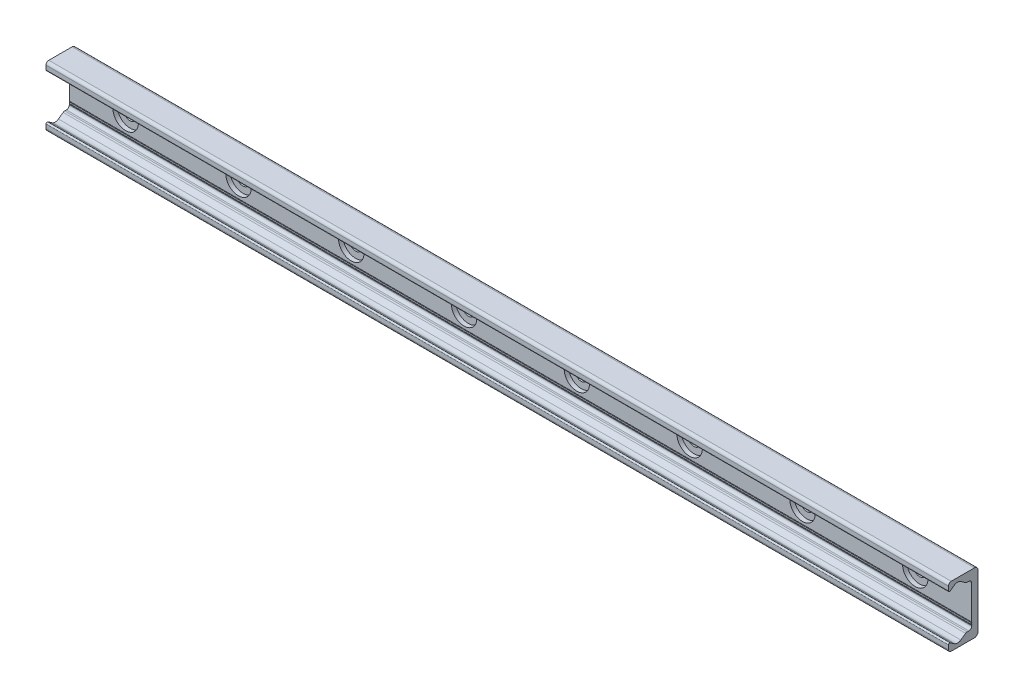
ISO-10303-21;
HEADER;
FILE_DESCRIPTION(('STEP AP214'),'2;1');
FILE_NAME('part.step','',(''),(''),'','','');
FILE_SCHEMA(('AUTOMOTIVE_DESIGN { 1 0 10303 214 1 1 1 1 }'));
ENDSEC;
DATA;
#1=APPLICATION_CONTEXT('core data for automotive mechanical design processes');
#2=APPLICATION_PROTOCOL_DEFINITION('international standard','automotive_design',2000,#1);
#3=PRODUCT_CONTEXT('',#1,'mechanical');
#4=PRODUCT('Part','Part','',(#3));
#5=PRODUCT_RELATED_PRODUCT_CATEGORY('part','',(#4));
#6=PRODUCT_DEFINITION_FORMATION('','',#4);
#7=PRODUCT_DEFINITION_CONTEXT('part definition',#1,'design');
#8=PRODUCT_DEFINITION('design','',#6,#7);
#9=PRODUCT_DEFINITION_SHAPE('','',#8);
#10=(LENGTH_UNIT() NAMED_UNIT(*) SI_UNIT(.MILLI.,.METRE.));
#11=(NAMED_UNIT(*) PLANE_ANGLE_UNIT() SI_UNIT($,.RADIAN.));
#12=(NAMED_UNIT(*) SI_UNIT($,.STERADIAN.) SOLID_ANGLE_UNIT());
#13=UNCERTAINTY_MEASURE_WITH_UNIT(LENGTH_MEASURE(1.E-05),#10,'distance_accuracy_value','');
#14=(GEOMETRIC_REPRESENTATION_CONTEXT(3) GLOBAL_UNCERTAINTY_ASSIGNED_CONTEXT((#13)) GLOBAL_UNIT_ASSIGNED_CONTEXT((#10,
#11,#12)) REPRESENTATION_CONTEXT('',''));
#15=CARTESIAN_POINT('',(0.,0.,0.));
#16=DIRECTION('',(0.,0.,1.));
#17=DIRECTION('',(1.,0.,0.));
#18=AXIS2_PLACEMENT_3D('',#15,#16,#17);
#19=CARTESIAN_POINT('',(-280.,0.,1.39999999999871));
#20=DIRECTION('',(0.,0.,1.));
#21=DIRECTION('',(1.,0.,0.));
#22=AXIS2_PLACEMENT_3D('',#19,#20,#21);
#23=PLANE('',#22);
#24=CARTESIAN_POINT('',(-280.,0.,1.39999999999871));
#25=DIRECTION('',(0.,0.,1.));
#26=DIRECTION('',(1.,0.,0.));
#27=AXIS2_PLACEMENT_3D('',#24,#25,#26);
#28=CIRCLE('',#27,4.50000000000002);
#29=CARTESIAN_POINT('',(-275.5,0.,1.39999999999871));
#30=VERTEX_POINT('',#29);
#31=EDGE_CURVE('E520',#30,#30,#28,.T.);
#32=ORIENTED_EDGE('',*,*,#31,.F.);
#33=EDGE_LOOP('',(#32));
#34=FACE_BOUND('',#33,.T.);
#35=CARTESIAN_POINT('',(-280.,0.,1.39999999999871));
#36=DIRECTION('',(0.,0.,1.));
#37=DIRECTION('',(1.,0.,0.));
#38=AXIS2_PLACEMENT_3D('',#35,#36,#37);
#39=CIRCLE('',#38,8.99999999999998);
#40=CARTESIAN_POINT('',(-271.,0.,1.39999999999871));
#41=VERTEX_POINT('',#40);
#42=EDGE_CURVE('E11',#41,#41,#39,.T.);
#43=ORIENTED_EDGE('',*,*,#42,.T.);
#44=EDGE_LOOP('',(#43));
#45=FACE_BOUND('',#44,.T.);
#46=ADVANCED_FACE('F39',(#34,#45),#23,.T.);
#47=CARTESIAN_POINT('',(-280.,0.,1.39999999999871));
#48=DIRECTION('',(0.,0.,1.));
#49=DIRECTION('',(1.,0.,0.));
#50=AXIS2_PLACEMENT_3D('',#47,#48,#49);
#51=CYLINDRICAL_SURFACE('',#50,8.99999999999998);
#52=CARTESIAN_POINT('',(-280.,0.,4.49999999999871));
#53=DIRECTION('',(0.,0.,1.));
#54=DIRECTION('',(1.,0.,0.));
#55=AXIS2_PLACEMENT_3D('',#52,#53,#54);
#56=CIRCLE('',#55,8.99999999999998);
#57=CARTESIAN_POINT('',(-271.,0.,4.49999999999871));
#58=VERTEX_POINT('',#57);
#59=EDGE_CURVE('E49',#58,#58,#56,.T.);
#60=CARTESIAN_POINT('',(-271.,0.,1.39999999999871));
#61=CARTESIAN_POINT('',(-271.,0.,1.43229166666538));
#62=CARTESIAN_POINT('',(-271.,0.,1.46458333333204));
#63=CARTESIAN_POINT('',(-271.,0.,1.52916666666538));
#64=CARTESIAN_POINT('',(-271.,0.,1.56145833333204));
#65=CARTESIAN_POINT('',(-271.,0.,1.62604166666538));
#66=CARTESIAN_POINT('',(-271.,0.,1.65833333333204));
#67=CARTESIAN_POINT('',(-271.,0.,1.72291666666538));
#68=CARTESIAN_POINT('',(-271.,0.,1.75520833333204));
#69=CARTESIAN_POINT('',(-271.,0.,1.81979166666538));
#70=CARTESIAN_POINT('',(-271.,0.,1.85208333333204));
#71=CARTESIAN_POINT('',(-271.,0.,1.91666666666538));
#72=CARTESIAN_POINT('',(-271.,0.,1.94895833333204));
#73=CARTESIAN_POINT('',(-271.,0.,2.01354166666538));
#74=CARTESIAN_POINT('',(-271.,0.,2.04583333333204));
#75=CARTESIAN_POINT('',(-271.,0.,2.11041666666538));
#76=CARTESIAN_POINT('',(-271.,0.,2.14270833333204));
#77=CARTESIAN_POINT('',(-271.,0.,2.20729166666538));
#78=CARTESIAN_POINT('',(-271.,0.,2.23958333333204));
#79=CARTESIAN_POINT('',(-271.,0.,2.30416666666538));
#80=CARTESIAN_POINT('',(-271.,0.,2.33645833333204));
#81=CARTESIAN_POINT('',(-271.,0.,2.40104166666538));
#82=CARTESIAN_POINT('',(-271.,0.,2.43333333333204));
#83=CARTESIAN_POINT('',(-271.,0.,2.49791666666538));
#84=CARTESIAN_POINT('',(-271.,0.,2.53020833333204));
#85=CARTESIAN_POINT('',(-271.,0.,2.59479166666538));
#86=CARTESIAN_POINT('',(-271.,0.,2.62708333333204));
#87=CARTESIAN_POINT('',(-271.,0.,2.69166666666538));
#88=CARTESIAN_POINT('',(-271.,0.,2.72395833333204));
#89=CARTESIAN_POINT('',(-271.,0.,2.78854166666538));
#90=CARTESIAN_POINT('',(-271.,0.,2.82083333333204));
#91=CARTESIAN_POINT('',(-271.,0.,2.88541666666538));
#92=CARTESIAN_POINT('',(-271.,0.,2.91770833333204));
#93=CARTESIAN_POINT('',(-271.,0.,2.98229166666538));
#94=CARTESIAN_POINT('',(-271.,0.,3.01458333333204));
#95=CARTESIAN_POINT('',(-271.,0.,3.07916666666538));
#96=CARTESIAN_POINT('',(-271.,0.,3.11145833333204));
#97=CARTESIAN_POINT('',(-271.,0.,3.17604166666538));
#98=CARTESIAN_POINT('',(-271.,0.,3.20833333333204));
#99=CARTESIAN_POINT('',(-271.,0.,3.27291666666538));
#100=CARTESIAN_POINT('',(-271.,0.,3.30520833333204));
#101=CARTESIAN_POINT('',(-271.,0.,3.36979166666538));
#102=CARTESIAN_POINT('',(-271.,0.,3.40208333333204));
#103=CARTESIAN_POINT('',(-271.,0.,3.46666666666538));
#104=CARTESIAN_POINT('',(-271.,0.,3.49895833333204));
#105=CARTESIAN_POINT('',(-271.,0.,3.56354166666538));
#106=CARTESIAN_POINT('',(-271.,0.,3.59583333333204));
#107=CARTESIAN_POINT('',(-271.,0.,3.66041666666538));
#108=CARTESIAN_POINT('',(-271.,0.,3.69270833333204));
#109=CARTESIAN_POINT('',(-271.,0.,3.75729166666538));
#110=CARTESIAN_POINT('',(-271.,0.,3.78958333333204));
#111=CARTESIAN_POINT('',(-271.,0.,3.85416666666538));
#112=CARTESIAN_POINT('',(-271.,0.,3.88645833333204));
#113=CARTESIAN_POINT('',(-271.,0.,3.95104166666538));
#114=CARTESIAN_POINT('',(-271.,0.,3.98333333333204));
#115=CARTESIAN_POINT('',(-271.,0.,4.04791666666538));
#116=CARTESIAN_POINT('',(-271.,0.,4.08020833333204));
#117=CARTESIAN_POINT('',(-271.,0.,4.14479166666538));
#118=CARTESIAN_POINT('',(-271.,0.,4.17708333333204));
#119=CARTESIAN_POINT('',(-271.,0.,4.24166666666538));
#120=CARTESIAN_POINT('',(-271.,0.,4.27395833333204));
#121=CARTESIAN_POINT('',(-271.,0.,4.33854166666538));
#122=CARTESIAN_POINT('',(-271.,0.,4.37083333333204));
#123=CARTESIAN_POINT('',(-271.,0.,4.43541666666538));
#124=CARTESIAN_POINT('',(-271.,0.,4.46770833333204));
#125=CARTESIAN_POINT('',(-271.,0.,4.49999999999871));
#126=B_SPLINE_CURVE_WITH_KNOTS('',3,(#60,#61,#62,#63,#64,#65,#66,#67,#68,#69,#70,#71,#72,#73,
#74,#75,#76,#77,#78,#79,#80,#81,#82,#83,#84,#85,#86,#87,#88,#89,#90,#91,#92,#93,#94,#95,#96,#97,
#98,#99,#100,#101,#102,#103,#104,#105,#106,#107,#108,#109,#110,#111,#112,#113,#114,#115,#116,
#117,#118,#119,#120,#121,#122,#123,#124,#125),.UNSPECIFIED.,.F.,.F.,(4,2,2,2,2,2,2,2,2,2,2,2,2,
2,2,2,2,2,2,2,2,2,2,2,2,2,2,2,2,2,2,2,4),(0.,0.0968750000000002,0.19375,0.290625,0.3875,
0.484375,0.58125,0.678125,0.775,0.871875,0.96875,1.065625,1.1625,1.259375,1.35625,1.453125,1.55,
1.646875,1.74375,1.840625,1.9375,2.034375,2.13125,2.228125,2.325,2.421875,2.51875,2.615625,
2.7125,2.809375,2.90625,3.003125,3.1),.UNSPECIFIED.);
#127=EDGE_CURVE('BSEAM490',#41,#58,#126,.T.);
#128=ORIENTED_EDGE('',*,*,#42,.F.);
#129=ORIENTED_EDGE('',*,*,#59,.T.);
#130=ORIENTED_EDGE('',*,*,#127,.T.);
#131=ORIENTED_EDGE('',*,*,#127,.F.);
#132=EDGE_LOOP('',(#128,#130,#129,#131));
#133=FACE_BOUND('',#132,.T.);
#134=ADVANCED_FACE('F490',(#133),#51,.F.);
#135=CARTESIAN_POINT('',(-200.,0.,1.39999999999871));
#136=DIRECTION('',(0.,0.,1.));
#137=DIRECTION('',(1.,0.,0.));
#138=AXIS2_PLACEMENT_3D('',#135,#136,#137);
#139=PLANE('',#138);
#140=CARTESIAN_POINT('',(-200.,0.,1.39999999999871));
#141=DIRECTION('',(0.,0.,1.));
#142=DIRECTION('',(1.,0.,0.));
#143=AXIS2_PLACEMENT_3D('',#140,#141,#142);
#144=CIRCLE('',#143,4.50000000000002);
#145=CARTESIAN_POINT('',(-195.5,0.,1.39999999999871));
#146=VERTEX_POINT('',#145);
#147=EDGE_CURVE('E524',#146,#146,#144,.T.);
#148=ORIENTED_EDGE('',*,*,#147,.F.);
#149=EDGE_LOOP('',(#148));
#150=FACE_BOUND('',#149,.T.);
#151=CARTESIAN_POINT('',(-200.,0.,1.39999999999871));
#152=DIRECTION('',(0.,0.,1.));
#153=DIRECTION('',(1.,0.,0.));
#154=AXIS2_PLACEMENT_3D('',#151,#152,#153);
#155=CIRCLE('',#154,8.99999999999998);
#156=CARTESIAN_POINT('',(-191.,0.,1.39999999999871));
#157=VERTEX_POINT('',#156);
#158=EDGE_CURVE('E482',#157,#157,#155,.T.);
#159=ORIENTED_EDGE('',*,*,#158,.T.);
#160=EDGE_LOOP('',(#159));
#161=FACE_BOUND('',#160,.T.);
#162=ADVANCED_FACE('F515',(#150,#161),#139,.T.);
#163=CARTESIAN_POINT('',(-200.,0.,1.39999999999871));
#164=DIRECTION('',(0.,0.,1.));
#165=DIRECTION('',(1.,0.,0.));
#166=AXIS2_PLACEMENT_3D('',#163,#164,#165);
#167=CYLINDRICAL_SURFACE('',#166,8.99999999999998);
#168=CARTESIAN_POINT('',(-200.,0.,4.49999999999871));
#169=DIRECTION('',(0.,0.,1.));
#170=DIRECTION('',(1.,0.,0.));
#171=AXIS2_PLACEMENT_3D('',#168,#169,#170);
#172=CIRCLE('',#171,8.99999999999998);
#173=CARTESIAN_POINT('',(-191.,0.,4.49999999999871));
#174=VERTEX_POINT('',#173);
#175=EDGE_CURVE('E478',#174,#174,#172,.T.);
#176=CARTESIAN_POINT('',(-191.,0.,1.39999999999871));
#177=CARTESIAN_POINT('',(-191.,0.,1.43229166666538));
#178=CARTESIAN_POINT('',(-191.,0.,1.46458333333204));
#179=CARTESIAN_POINT('',(-191.,0.,1.52916666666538));
#180=CARTESIAN_POINT('',(-191.,0.,1.56145833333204));
#181=CARTESIAN_POINT('',(-191.,0.,1.62604166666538));
#182=CARTESIAN_POINT('',(-191.,0.,1.65833333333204));
#183=CARTESIAN_POINT('',(-191.,0.,1.72291666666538));
#184=CARTESIAN_POINT('',(-191.,0.,1.75520833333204));
#185=CARTESIAN_POINT('',(-191.,0.,1.81979166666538));
#186=CARTESIAN_POINT('',(-191.,0.,1.85208333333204));
#187=CARTESIAN_POINT('',(-191.,0.,1.91666666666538));
#188=CARTESIAN_POINT('',(-191.,0.,1.94895833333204));
#189=CARTESIAN_POINT('',(-191.,0.,2.01354166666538));
#190=CARTESIAN_POINT('',(-191.,0.,2.04583333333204));
#191=CARTESIAN_POINT('',(-191.,0.,2.11041666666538));
#192=CARTESIAN_POINT('',(-191.,0.,2.14270833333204));
#193=CARTESIAN_POINT('',(-191.,0.,2.20729166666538));
#194=CARTESIAN_POINT('',(-191.,0.,2.23958333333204));
#195=CARTESIAN_POINT('',(-191.,0.,2.30416666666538));
#196=CARTESIAN_POINT('',(-191.,0.,2.33645833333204));
#197=CARTESIAN_POINT('',(-191.,0.,2.40104166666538));
#198=CARTESIAN_POINT('',(-191.,0.,2.43333333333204));
#199=CARTESIAN_POINT('',(-191.,0.,2.49791666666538));
#200=CARTESIAN_POINT('',(-191.,0.,2.53020833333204));
#201=CARTESIAN_POINT('',(-191.,0.,2.59479166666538));
#202=CARTESIAN_POINT('',(-191.,0.,2.62708333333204));
#203=CARTESIAN_POINT('',(-191.,0.,2.69166666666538));
#204=CARTESIAN_POINT('',(-191.,0.,2.72395833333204));
#205=CARTESIAN_POINT('',(-191.,0.,2.78854166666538));
#206=CARTESIAN_POINT('',(-191.,0.,2.82083333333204));
#207=CARTESIAN_POINT('',(-191.,0.,2.88541666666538));
#208=CARTESIAN_POINT('',(-191.,0.,2.91770833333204));
#209=CARTESIAN_POINT('',(-191.,0.,2.98229166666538));
#210=CARTESIAN_POINT('',(-191.,0.,3.01458333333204));
#211=CARTESIAN_POINT('',(-191.,0.,3.07916666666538));
#212=CARTESIAN_POINT('',(-191.,0.,3.11145833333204));
#213=CARTESIAN_POINT('',(-191.,0.,3.17604166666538));
#214=CARTESIAN_POINT('',(-191.,0.,3.20833333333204));
#215=CARTESIAN_POINT('',(-191.,0.,3.27291666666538));
#216=CARTESIAN_POINT('',(-191.,0.,3.30520833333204));
#217=CARTESIAN_POINT('',(-191.,0.,3.36979166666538));
#218=CARTESIAN_POINT('',(-191.,0.,3.40208333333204));
#219=CARTESIAN_POINT('',(-191.,0.,3.46666666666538));
#220=CARTESIAN_POINT('',(-191.,0.,3.49895833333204));
#221=CARTESIAN_POINT('',(-191.,0.,3.56354166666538));
#222=CARTESIAN_POINT('',(-191.,0.,3.59583333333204));
#223=CARTESIAN_POINT('',(-191.,0.,3.66041666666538));
#224=CARTESIAN_POINT('',(-191.,0.,3.69270833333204));
#225=CARTESIAN_POINT('',(-191.,0.,3.75729166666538));
#226=CARTESIAN_POINT('',(-191.,0.,3.78958333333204));
#227=CARTESIAN_POINT('',(-191.,0.,3.85416666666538));
#228=CARTESIAN_POINT('',(-191.,0.,3.88645833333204));
#229=CARTESIAN_POINT('',(-191.,0.,3.95104166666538));
#230=CARTESIAN_POINT('',(-191.,0.,3.98333333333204));
#231=CARTESIAN_POINT('',(-191.,0.,4.04791666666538));
#232=CARTESIAN_POINT('',(-191.,0.,4.08020833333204));
#233=CARTESIAN_POINT('',(-191.,0.,4.14479166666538));
#234=CARTESIAN_POINT('',(-191.,0.,4.17708333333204));
#235=CARTESIAN_POINT('',(-191.,0.,4.24166666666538));
#236=CARTESIAN_POINT('',(-191.,0.,4.27395833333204));
#237=CARTESIAN_POINT('',(-191.,0.,4.33854166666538));
#238=CARTESIAN_POINT('',(-191.,0.,4.37083333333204));
#239=CARTESIAN_POINT('',(-191.,0.,4.43541666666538));
#240=CARTESIAN_POINT('',(-191.,0.,4.46770833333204));
#241=CARTESIAN_POINT('',(-191.,0.,4.49999999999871));
#242=B_SPLINE_CURVE_WITH_KNOTS('',3,(#176,#177,#178,#179,#180,#181,#182,#183,#184,#185,#186,
#187,#188,#189,#190,#191,#192,#193,#194,#195,#196,#197,#198,#199,#200,#201,#202,#203,#204,#205,
#206,#207,#208,#209,#210,#211,#212,#213,#214,#215,#216,#217,#218,#219,#220,#221,#222,#223,#224,
#225,#226,#227,#228,#229,#230,#231,#232,#233,#234,#235,#236,#237,#238,#239,#240,#241),
.UNSPECIFIED.,.F.,.F.,(4,2,2,2,2,2,2,2,2,2,2,2,2,2,2,2,2,2,2,2,2,2,2,2,2,2,2,2,2,2,2,2,4),(0.,
0.0968750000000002,0.19375,0.290625,0.3875,0.484375,0.58125,0.678125,0.775,0.871875,0.96875,
1.065625,1.1625,1.259375,1.35625,1.453125,1.55,1.646875,1.74375,1.840625,1.9375,2.034375,
2.13125,2.228125,2.325,2.421875,2.51875,2.615625,2.7125,2.809375,2.90625,3.003125,3.1),.UNSPECIFIED.);
#243=EDGE_CURVE('BSEAM914',#157,#174,#242,.T.);
#244=ORIENTED_EDGE('',*,*,#158,.F.);
#245=ORIENTED_EDGE('',*,*,#175,.T.);
#246=ORIENTED_EDGE('',*,*,#243,.T.);
#247=ORIENTED_EDGE('',*,*,#243,.F.);
#248=EDGE_LOOP('',(#244,#246,#245,#247));
#249=FACE_BOUND('',#248,.T.);
#250=ADVANCED_FACE('F914',(#249),#167,.F.);
#251=CARTESIAN_POINT('',(-120.,0.,1.39999999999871));
#252=DIRECTION('',(0.,0.,1.));
#253=DIRECTION('',(1.,0.,0.));
#254=AXIS2_PLACEMENT_3D('',#251,#252,#253);
#255=PLANE('',#254);
#256=CARTESIAN_POINT('',(-120.,0.,1.39999999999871));
#257=DIRECTION('',(0.,0.,1.));
#258=DIRECTION('',(1.,0.,0.));
#259=AXIS2_PLACEMENT_3D('',#256,#257,#258);
#260=CIRCLE('',#259,4.50000000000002);
#261=CARTESIAN_POINT('',(-115.5,0.,1.39999999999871));
#262=VERTEX_POINT('',#261);
#263=EDGE_CURVE('E528',#262,#262,#260,.T.);
#264=ORIENTED_EDGE('',*,*,#263,.F.);
#265=EDGE_LOOP('',(#264));
#266=FACE_BOUND('',#265,.T.);
#267=CARTESIAN_POINT('',(-120.,0.,1.39999999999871));
#268=DIRECTION('',(0.,0.,1.));
#269=DIRECTION('',(1.,0.,0.));
#270=AXIS2_PLACEMENT_3D('',#267,#268,#269);
#271=CIRCLE('',#270,8.99999999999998);
#272=CARTESIAN_POINT('',(-111.,0.,1.39999999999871));
#273=VERTEX_POINT('',#272);
#274=EDGE_CURVE('E474',#273,#273,#271,.T.);
#275=ORIENTED_EDGE('',*,*,#274,.T.);
#276=EDGE_LOOP('',(#275));
#277=FACE_BOUND('',#276,.T.);
#278=ADVANCED_FACE('F910',(#266,#277),#255,.T.);
#279=CARTESIAN_POINT('',(-120.,0.,1.39999999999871));
#280=DIRECTION('',(0.,0.,1.));
#281=DIRECTION('',(1.,0.,0.));
#282=AXIS2_PLACEMENT_3D('',#279,#280,#281);
#283=CYLINDRICAL_SURFACE('',#282,8.99999999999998);
#284=CARTESIAN_POINT('',(-120.,0.,4.49999999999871));
#285=DIRECTION('',(0.,0.,1.));
#286=DIRECTION('',(1.,0.,0.));
#287=AXIS2_PLACEMENT_3D('',#284,#285,#286);
#288=CIRCLE('',#287,8.99999999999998);
#289=CARTESIAN_POINT('',(-111.,0.,4.49999999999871));
#290=VERTEX_POINT('',#289);
#291=EDGE_CURVE('E470',#290,#290,#288,.T.);
#292=CARTESIAN_POINT('',(-111.,0.,1.39999999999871));
#293=CARTESIAN_POINT('',(-111.,0.,1.43229166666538));
#294=CARTESIAN_POINT('',(-111.,0.,1.46458333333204));
#295=CARTESIAN_POINT('',(-111.,0.,1.52916666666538));
#296=CARTESIAN_POINT('',(-111.,0.,1.56145833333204));
#297=CARTESIAN_POINT('',(-111.,0.,1.62604166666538));
#298=CARTESIAN_POINT('',(-111.,0.,1.65833333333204));
#299=CARTESIAN_POINT('',(-111.,0.,1.72291666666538));
#300=CARTESIAN_POINT('',(-111.,0.,1.75520833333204));
#301=CARTESIAN_POINT('',(-111.,0.,1.81979166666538));
#302=CARTESIAN_POINT('',(-111.,0.,1.85208333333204));
#303=CARTESIAN_POINT('',(-111.,0.,1.91666666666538));
#304=CARTESIAN_POINT('',(-111.,0.,1.94895833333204));
#305=CARTESIAN_POINT('',(-111.,0.,2.01354166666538));
#306=CARTESIAN_POINT('',(-111.,0.,2.04583333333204));
#307=CARTESIAN_POINT('',(-111.,0.,2.11041666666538));
#308=CARTESIAN_POINT('',(-111.,0.,2.14270833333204));
#309=CARTESIAN_POINT('',(-111.,0.,2.20729166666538));
#310=CARTESIAN_POINT('',(-111.,0.,2.23958333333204));
#311=CARTESIAN_POINT('',(-111.,0.,2.30416666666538));
#312=CARTESIAN_POINT('',(-111.,0.,2.33645833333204));
#313=CARTESIAN_POINT('',(-111.,0.,2.40104166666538));
#314=CARTESIAN_POINT('',(-111.,0.,2.43333333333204));
#315=CARTESIAN_POINT('',(-111.,0.,2.49791666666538));
#316=CARTESIAN_POINT('',(-111.,0.,2.53020833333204));
#317=CARTESIAN_POINT('',(-111.,0.,2.59479166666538));
#318=CARTESIAN_POINT('',(-111.,0.,2.62708333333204));
#319=CARTESIAN_POINT('',(-111.,0.,2.69166666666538));
#320=CARTESIAN_POINT('',(-111.,0.,2.72395833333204));
#321=CARTESIAN_POINT('',(-111.,0.,2.78854166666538));
#322=CARTESIAN_POINT('',(-111.,0.,2.82083333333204));
#323=CARTESIAN_POINT('',(-111.,0.,2.88541666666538));
#324=CARTESIAN_POINT('',(-111.,0.,2.91770833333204));
#325=CARTESIAN_POINT('',(-111.,0.,2.98229166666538));
#326=CARTESIAN_POINT('',(-111.,0.,3.01458333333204));
#327=CARTESIAN_POINT('',(-111.,0.,3.07916666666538));
#328=CARTESIAN_POINT('',(-111.,0.,3.11145833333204));
#329=CARTESIAN_POINT('',(-111.,0.,3.17604166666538));
#330=CARTESIAN_POINT('',(-111.,0.,3.20833333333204));
#331=CARTESIAN_POINT('',(-111.,0.,3.27291666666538));
#332=CARTESIAN_POINT('',(-111.,0.,3.30520833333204));
#333=CARTESIAN_POINT('',(-111.,0.,3.36979166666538));
#334=CARTESIAN_POINT('',(-111.,0.,3.40208333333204));
#335=CARTESIAN_POINT('',(-111.,0.,3.46666666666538));
#336=CARTESIAN_POINT('',(-111.,0.,3.49895833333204));
#337=CARTESIAN_POINT('',(-111.,0.,3.56354166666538));
#338=CARTESIAN_POINT('',(-111.,0.,3.59583333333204));
#339=CARTESIAN_POINT('',(-111.,0.,3.66041666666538));
#340=CARTESIAN_POINT('',(-111.,0.,3.69270833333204));
#341=CARTESIAN_POINT('',(-111.,0.,3.75729166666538));
#342=CARTESIAN_POINT('',(-111.,0.,3.78958333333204));
#343=CARTESIAN_POINT('',(-111.,0.,3.85416666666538));
#344=CARTESIAN_POINT('',(-111.,0.,3.88645833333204));
#345=CARTESIAN_POINT('',(-111.,0.,3.95104166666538));
#346=CARTESIAN_POINT('',(-111.,0.,3.98333333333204));
#347=CARTESIAN_POINT('',(-111.,0.,4.04791666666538));
#348=CARTESIAN_POINT('',(-111.,0.,4.08020833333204));
#349=CARTESIAN_POINT('',(-111.,0.,4.14479166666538));
#350=CARTESIAN_POINT('',(-111.,0.,4.17708333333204));
#351=CARTESIAN_POINT('',(-111.,0.,4.24166666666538));
#352=CARTESIAN_POINT('',(-111.,0.,4.27395833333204));
#353=CARTESIAN_POINT('',(-111.,0.,4.33854166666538));
#354=CARTESIAN_POINT('',(-111.,0.,4.37083333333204));
#355=CARTESIAN_POINT('',(-111.,0.,4.43541666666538));
#356=CARTESIAN_POINT('',(-111.,0.,4.46770833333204));
#357=CARTESIAN_POINT('',(-111.,0.,4.49999999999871));
#358=B_SPLINE_CURVE_WITH_KNOTS('',3,(#292,#293,#294,#295,#296,#297,#298,#299,#300,#301,#302,
#303,#304,#305,#306,#307,#308,#309,#310,#311,#312,#313,#314,#315,#316,#317,#318,#319,#320,#321,
#322,#323,#324,#325,#326,#327,#328,#329,#330,#331,#332,#333,#334,#335,#336,#337,#338,#339,#340,
#341,#342,#343,#344,#345,#346,#347,#348,#349,#350,#351,#352,#353,#354,#355,#356,#357),
.UNSPECIFIED.,.F.,.F.,(4,2,2,2,2,2,2,2,2,2,2,2,2,2,2,2,2,2,2,2,2,2,2,2,2,2,2,2,2,2,2,2,4),(0.,
0.0968750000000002,0.19375,0.290625,0.3875,0.484375,0.58125,0.678125,0.775,0.871875,0.96875,
1.065625,1.1625,1.259375,1.35625,1.453125,1.55,1.646875,1.74375,1.840625,1.9375,2.034375,
2.13125,2.228125,2.325,2.421875,2.51875,2.615625,2.7125,2.809375,2.90625,3.003125,3.1),.UNSPECIFIED.);
#359=EDGE_CURVE('BSEAM906',#273,#290,#358,.T.);
#360=ORIENTED_EDGE('',*,*,#274,.F.);
#361=ORIENTED_EDGE('',*,*,#291,.T.);
#362=ORIENTED_EDGE('',*,*,#359,.T.);
#363=ORIENTED_EDGE('',*,*,#359,.F.);
#364=EDGE_LOOP('',(#360,#362,#361,#363));
#365=FACE_BOUND('',#364,.T.);
#366=ADVANCED_FACE('F906',(#365),#283,.F.);
#367=CARTESIAN_POINT('',(-40.,0.,1.39999999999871));
#368=DIRECTION('',(0.,0.,1.));
#369=DIRECTION('',(1.,0.,0.));
#370=AXIS2_PLACEMENT_3D('',#367,#368,#369);
#371=PLANE('',#370);
#372=CARTESIAN_POINT('',(-40.,0.,1.39999999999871));
#373=DIRECTION('',(0.,0.,1.));
#374=DIRECTION('',(1.,0.,0.));
#375=AXIS2_PLACEMENT_3D('',#372,#373,#374);
#376=CIRCLE('',#375,4.50000000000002);
#377=CARTESIAN_POINT('',(-35.5,0.,1.39999999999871));
#378=VERTEX_POINT('',#377);
#379=EDGE_CURVE('E540',#378,#378,#376,.T.);
#380=ORIENTED_EDGE('',*,*,#379,.F.);
#381=EDGE_LOOP('',(#380));
#382=FACE_BOUND('',#381,.T.);
#383=CARTESIAN_POINT('',(-40.,0.,1.39999999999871));
#384=DIRECTION('',(0.,0.,1.));
#385=DIRECTION('',(1.,0.,0.));
#386=AXIS2_PLACEMENT_3D('',#383,#384,#385);
#387=CIRCLE('',#386,8.99999999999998);
#388=CARTESIAN_POINT('',(-31.,0.,1.39999999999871));
#389=VERTEX_POINT('',#388);
#390=EDGE_CURVE('E466',#389,#389,#387,.T.);
#391=ORIENTED_EDGE('',*,*,#390,.T.);
#392=EDGE_LOOP('',(#391));
#393=FACE_BOUND('',#392,.T.);
#394=ADVANCED_FACE('F902',(#382,#393),#371,.T.);
#395=CARTESIAN_POINT('',(-40.,0.,1.39999999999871));
#396=DIRECTION('',(0.,0.,1.));
#397=DIRECTION('',(1.,0.,0.));
#398=AXIS2_PLACEMENT_3D('',#395,#396,#397);
#399=CYLINDRICAL_SURFACE('',#398,8.99999999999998);
#400=CARTESIAN_POINT('',(-40.,0.,4.49999999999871));
#401=DIRECTION('',(0.,0.,1.));
#402=DIRECTION('',(1.,0.,0.));
#403=AXIS2_PLACEMENT_3D('',#400,#401,#402);
#404=CIRCLE('',#403,8.99999999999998);
#405=CARTESIAN_POINT('',(-31.,0.,4.49999999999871));
#406=VERTEX_POINT('',#405);
#407=EDGE_CURVE('E462',#406,#406,#404,.T.);
#408=CARTESIAN_POINT('',(-31.,0.,1.39999999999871));
#409=CARTESIAN_POINT('',(-31.,0.,1.43229166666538));
#410=CARTESIAN_POINT('',(-31.,0.,1.46458333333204));
#411=CARTESIAN_POINT('',(-31.,0.,1.52916666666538));
#412=CARTESIAN_POINT('',(-31.,0.,1.56145833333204));
#413=CARTESIAN_POINT('',(-31.,0.,1.62604166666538));
#414=CARTESIAN_POINT('',(-31.,0.,1.65833333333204));
#415=CARTESIAN_POINT('',(-31.,0.,1.72291666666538));
#416=CARTESIAN_POINT('',(-31.,0.,1.75520833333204));
#417=CARTESIAN_POINT('',(-31.,0.,1.81979166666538));
#418=CARTESIAN_POINT('',(-31.,0.,1.85208333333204));
#419=CARTESIAN_POINT('',(-31.,0.,1.91666666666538));
#420=CARTESIAN_POINT('',(-31.,0.,1.94895833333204));
#421=CARTESIAN_POINT('',(-31.,0.,2.01354166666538));
#422=CARTESIAN_POINT('',(-31.,0.,2.04583333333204));
#423=CARTESIAN_POINT('',(-31.,0.,2.11041666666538));
#424=CARTESIAN_POINT('',(-31.,0.,2.14270833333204));
#425=CARTESIAN_POINT('',(-31.,0.,2.20729166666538));
#426=CARTESIAN_POINT('',(-31.,0.,2.23958333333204));
#427=CARTESIAN_POINT('',(-31.,0.,2.30416666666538));
#428=CARTESIAN_POINT('',(-31.,0.,2.33645833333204));
#429=CARTESIAN_POINT('',(-31.,0.,2.40104166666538));
#430=CARTESIAN_POINT('',(-31.,0.,2.43333333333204));
#431=CARTESIAN_POINT('',(-31.,0.,2.49791666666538));
#432=CARTESIAN_POINT('',(-31.,0.,2.53020833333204));
#433=CARTESIAN_POINT('',(-31.,0.,2.59479166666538));
#434=CARTESIAN_POINT('',(-31.,0.,2.62708333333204));
#435=CARTESIAN_POINT('',(-31.,0.,2.69166666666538));
#436=CARTESIAN_POINT('',(-31.,0.,2.72395833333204));
#437=CARTESIAN_POINT('',(-31.,0.,2.78854166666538));
#438=CARTESIAN_POINT('',(-31.,0.,2.82083333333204));
#439=CARTESIAN_POINT('',(-31.,0.,2.88541666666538));
#440=CARTESIAN_POINT('',(-31.,0.,2.91770833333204));
#441=CARTESIAN_POINT('',(-31.,0.,2.98229166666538));
#442=CARTESIAN_POINT('',(-31.,0.,3.01458333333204));
#443=CARTESIAN_POINT('',(-31.,0.,3.07916666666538));
#444=CARTESIAN_POINT('',(-31.,0.,3.11145833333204));
#445=CARTESIAN_POINT('',(-31.,0.,3.17604166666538));
#446=CARTESIAN_POINT('',(-31.,0.,3.20833333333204));
#447=CARTESIAN_POINT('',(-31.,0.,3.27291666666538));
#448=CARTESIAN_POINT('',(-31.,0.,3.30520833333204));
#449=CARTESIAN_POINT('',(-31.,0.,3.36979166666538));
#450=CARTESIAN_POINT('',(-31.,0.,3.40208333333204));
#451=CARTESIAN_POINT('',(-31.,0.,3.46666666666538));
#452=CARTESIAN_POINT('',(-31.,0.,3.49895833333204));
#453=CARTESIAN_POINT('',(-31.,0.,3.56354166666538));
#454=CARTESIAN_POINT('',(-31.,0.,3.59583333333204));
#455=CARTESIAN_POINT('',(-31.,0.,3.66041666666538));
#456=CARTESIAN_POINT('',(-31.,0.,3.69270833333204));
#457=CARTESIAN_POINT('',(-31.,0.,3.75729166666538));
#458=CARTESIAN_POINT('',(-31.,0.,3.78958333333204));
#459=CARTESIAN_POINT('',(-31.,0.,3.85416666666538));
#460=CARTESIAN_POINT('',(-31.,0.,3.88645833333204));
#461=CARTESIAN_POINT('',(-31.,0.,3.95104166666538));
#462=CARTESIAN_POINT('',(-31.,0.,3.98333333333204));
#463=CARTESIAN_POINT('',(-31.,0.,4.04791666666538));
#464=CARTESIAN_POINT('',(-31.,0.,4.08020833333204));
#465=CARTESIAN_POINT('',(-31.,0.,4.14479166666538));
#466=CARTESIAN_POINT('',(-31.,0.,4.17708333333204));
#467=CARTESIAN_POINT('',(-31.,0.,4.24166666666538));
#468=CARTESIAN_POINT('',(-31.,0.,4.27395833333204));
#469=CARTESIAN_POINT('',(-31.,0.,4.33854166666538));
#470=CARTESIAN_POINT('',(-31.,0.,4.37083333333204));
#471=CARTESIAN_POINT('',(-31.,0.,4.43541666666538));
#472=CARTESIAN_POINT('',(-31.,0.,4.46770833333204));
#473=CARTESIAN_POINT('',(-31.,0.,4.49999999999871));
#474=B_SPLINE_CURVE_WITH_KNOTS('',3,(#408,#409,#410,#411,#412,#413,#414,#415,#416,#417,#418,
#419,#420,#421,#422,#423,#424,#425,#426,#427,#428,#429,#430,#431,#432,#433,#434,#435,#436,#437,
#438,#439,#440,#441,#442,#443,#444,#445,#446,#447,#448,#449,#450,#451,#452,#453,#454,#455,#456,
#457,#458,#459,#460,#461,#462,#463,#464,#465,#466,#467,#468,#469,#470,#471,#472,#473),
.UNSPECIFIED.,.F.,.F.,(4,2,2,2,2,2,2,2,2,2,2,2,2,2,2,2,2,2,2,2,2,2,2,2,2,2,2,2,2,2,2,2,4),(0.,
0.0968750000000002,0.19375,0.290625,0.3875,0.484375,0.58125,0.678125,0.775,0.871875,0.96875,
1.065625,1.1625,1.259375,1.35625,1.453125,1.55,1.646875,1.74375,1.840625,1.9375,2.034375,
2.13125,2.228125,2.325,2.421875,2.51875,2.615625,2.7125,2.809375,2.90625,3.003125,3.1),.UNSPECIFIED.);
#475=EDGE_CURVE('BSEAM898',#389,#406,#474,.T.);
#476=ORIENTED_EDGE('',*,*,#390,.F.);
#477=ORIENTED_EDGE('',*,*,#407,.T.);
#478=ORIENTED_EDGE('',*,*,#475,.T.);
#479=ORIENTED_EDGE('',*,*,#475,.F.);
#480=EDGE_LOOP('',(#476,#478,#477,#479));
#481=FACE_BOUND('',#480,.T.);
#482=ADVANCED_FACE('F898',(#481),#399,.F.);
#483=CARTESIAN_POINT('',(40.,0.,1.39999999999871));
#484=DIRECTION('',(0.,0.,1.));
#485=DIRECTION('',(1.,0.,0.));
#486=AXIS2_PLACEMENT_3D('',#483,#484,#485);
#487=PLANE('',#486);
#488=CARTESIAN_POINT('',(40.,0.,1.39999999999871));
#489=DIRECTION('',(0.,0.,1.));
#490=DIRECTION('',(1.,0.,0.));
#491=AXIS2_PLACEMENT_3D('',#488,#489,#490);
#492=CIRCLE('',#491,4.50000000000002);
#493=CARTESIAN_POINT('',(44.5000000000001,0.,1.39999999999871));
#494=VERTEX_POINT('',#493);
#495=EDGE_CURVE('E544',#494,#494,#492,.T.);
#496=ORIENTED_EDGE('',*,*,#495,.F.);
#497=EDGE_LOOP('',(#496));
#498=FACE_BOUND('',#497,.T.);
#499=CARTESIAN_POINT('',(40.,0.,1.39999999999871));
#500=DIRECTION('',(0.,0.,1.));
#501=DIRECTION('',(1.,0.,0.));
#502=AXIS2_PLACEMENT_3D('',#499,#500,#501);
#503=CIRCLE('',#502,8.99999999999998);
#504=CARTESIAN_POINT('',(49.,0.,1.39999999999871));
#505=VERTEX_POINT('',#504);
#506=EDGE_CURVE('E458',#505,#505,#503,.T.);
#507=ORIENTED_EDGE('',*,*,#506,.T.);
#508=EDGE_LOOP('',(#507));
#509=FACE_BOUND('',#508,.T.);
#510=ADVANCED_FACE('F894',(#498,#509),#487,.T.);
#511=CARTESIAN_POINT('',(40.,0.,1.39999999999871));
#512=DIRECTION('',(0.,0.,1.));
#513=DIRECTION('',(1.,0.,0.));
#514=AXIS2_PLACEMENT_3D('',#511,#512,#513);
#515=CYLINDRICAL_SURFACE('',#514,8.99999999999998);
#516=CARTESIAN_POINT('',(40.,0.,4.49999999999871));
#517=DIRECTION('',(0.,0.,1.));
#518=DIRECTION('',(1.,0.,0.));
#519=AXIS2_PLACEMENT_3D('',#516,#517,#518);
#520=CIRCLE('',#519,8.99999999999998);
#521=CARTESIAN_POINT('',(49.,0.,4.49999999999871));
#522=VERTEX_POINT('',#521);
#523=EDGE_CURVE('E454',#522,#522,#520,.T.);
#524=CARTESIAN_POINT('',(49.,0.,1.39999999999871));
#525=CARTESIAN_POINT('',(49.,0.,1.43229166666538));
#526=CARTESIAN_POINT('',(49.,0.,1.46458333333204));
#527=CARTESIAN_POINT('',(49.,0.,1.52916666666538));
#528=CARTESIAN_POINT('',(49.,0.,1.56145833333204));
#529=CARTESIAN_POINT('',(49.,0.,1.62604166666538));
#530=CARTESIAN_POINT('',(49.,0.,1.65833333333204));
#531=CARTESIAN_POINT('',(49.,0.,1.72291666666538));
#532=CARTESIAN_POINT('',(49.,0.,1.75520833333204));
#533=CARTESIAN_POINT('',(49.,0.,1.81979166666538));
#534=CARTESIAN_POINT('',(49.,0.,1.85208333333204));
#535=CARTESIAN_POINT('',(49.,0.,1.91666666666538));
#536=CARTESIAN_POINT('',(49.,0.,1.94895833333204));
#537=CARTESIAN_POINT('',(49.,0.,2.01354166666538));
#538=CARTESIAN_POINT('',(49.,0.,2.04583333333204));
#539=CARTESIAN_POINT('',(49.,0.,2.11041666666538));
#540=CARTESIAN_POINT('',(49.,0.,2.14270833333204));
#541=CARTESIAN_POINT('',(49.,0.,2.20729166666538));
#542=CARTESIAN_POINT('',(49.,0.,2.23958333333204));
#543=CARTESIAN_POINT('',(49.,0.,2.30416666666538));
#544=CARTESIAN_POINT('',(49.,0.,2.33645833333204));
#545=CARTESIAN_POINT('',(49.,0.,2.40104166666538));
#546=CARTESIAN_POINT('',(49.,0.,2.43333333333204));
#547=CARTESIAN_POINT('',(49.,0.,2.49791666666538));
#548=CARTESIAN_POINT('',(49.,0.,2.53020833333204));
#549=CARTESIAN_POINT('',(49.,0.,2.59479166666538));
#550=CARTESIAN_POINT('',(49.,0.,2.62708333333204));
#551=CARTESIAN_POINT('',(49.,0.,2.69166666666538));
#552=CARTESIAN_POINT('',(49.,0.,2.72395833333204));
#553=CARTESIAN_POINT('',(49.,0.,2.78854166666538));
#554=CARTESIAN_POINT('',(49.,0.,2.82083333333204));
#555=CARTESIAN_POINT('',(49.,0.,2.88541666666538));
#556=CARTESIAN_POINT('',(49.,0.,2.91770833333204));
#557=CARTESIAN_POINT('',(49.,0.,2.98229166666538));
#558=CARTESIAN_POINT('',(49.,0.,3.01458333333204));
#559=CARTESIAN_POINT('',(49.,0.,3.07916666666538));
#560=CARTESIAN_POINT('',(49.,0.,3.11145833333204));
#561=CARTESIAN_POINT('',(49.,0.,3.17604166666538));
#562=CARTESIAN_POINT('',(49.,0.,3.20833333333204));
#563=CARTESIAN_POINT('',(49.,0.,3.27291666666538));
#564=CARTESIAN_POINT('',(49.,0.,3.30520833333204));
#565=CARTESIAN_POINT('',(49.,0.,3.36979166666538));
#566=CARTESIAN_POINT('',(49.,0.,3.40208333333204));
#567=CARTESIAN_POINT('',(49.,0.,3.46666666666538));
#568=CARTESIAN_POINT('',(49.,0.,3.49895833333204));
#569=CARTESIAN_POINT('',(49.,0.,3.56354166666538));
#570=CARTESIAN_POINT('',(49.,0.,3.59583333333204));
#571=CARTESIAN_POINT('',(49.,0.,3.66041666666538));
#572=CARTESIAN_POINT('',(49.,0.,3.69270833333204));
#573=CARTESIAN_POINT('',(49.,0.,3.75729166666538));
#574=CARTESIAN_POINT('',(49.,0.,3.78958333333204));
#575=CARTESIAN_POINT('',(49.,0.,3.85416666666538));
#576=CARTESIAN_POINT('',(49.,0.,3.88645833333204));
#577=CARTESIAN_POINT('',(49.,0.,3.95104166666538));
#578=CARTESIAN_POINT('',(49.,0.,3.98333333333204));
#579=CARTESIAN_POINT('',(49.,0.,4.04791666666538));
#580=CARTESIAN_POINT('',(49.,0.,4.08020833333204));
#581=CARTESIAN_POINT('',(49.,0.,4.14479166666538));
#582=CARTESIAN_POINT('',(49.,0.,4.17708333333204));
#583=CARTESIAN_POINT('',(49.,0.,4.24166666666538));
#584=CARTESIAN_POINT('',(49.,0.,4.27395833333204));
#585=CARTESIAN_POINT('',(49.,0.,4.33854166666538));
#586=CARTESIAN_POINT('',(49.,0.,4.37083333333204));
#587=CARTESIAN_POINT('',(49.,0.,4.43541666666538));
#588=CARTESIAN_POINT('',(49.,0.,4.46770833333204));
#589=CARTESIAN_POINT('',(49.,0.,4.49999999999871));
#590=B_SPLINE_CURVE_WITH_KNOTS('',3,(#524,#525,#526,#527,#528,#529,#530,#531,#532,#533,#534,
#535,#536,#537,#538,#539,#540,#541,#542,#543,#544,#545,#546,#547,#548,#549,#550,#551,#552,#553,
#554,#555,#556,#557,#558,#559,#560,#561,#562,#563,#564,#565,#566,#567,#568,#569,#570,#571,#572,
#573,#574,#575,#576,#577,#578,#579,#580,#581,#582,#583,#584,#585,#586,#587,#588,#589),
.UNSPECIFIED.,.F.,.F.,(4,2,2,2,2,2,2,2,2,2,2,2,2,2,2,2,2,2,2,2,2,2,2,2,2,2,2,2,2,2,2,2,4),(0.,
0.0968750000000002,0.19375,0.290625,0.3875,0.484375,0.58125,0.678125,0.775,0.871875,0.96875,
1.065625,1.1625,1.259375,1.35625,1.453125,1.55,1.646875,1.74375,1.840625,1.9375,2.034375,
2.13125,2.228125,2.325,2.421875,2.51875,2.615625,2.7125,2.809375,2.90625,3.003125,3.1),.UNSPECIFIED.);
#591=EDGE_CURVE('BSEAM890',#505,#522,#590,.T.);
#592=ORIENTED_EDGE('',*,*,#506,.F.);
#593=ORIENTED_EDGE('',*,*,#523,.T.);
#594=ORIENTED_EDGE('',*,*,#591,.T.);
#595=ORIENTED_EDGE('',*,*,#591,.F.);
#596=EDGE_LOOP('',(#592,#594,#593,#595));
#597=FACE_BOUND('',#596,.T.);
#598=ADVANCED_FACE('F890',(#597),#515,.F.);
#599=CARTESIAN_POINT('',(120.,0.,1.39999999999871));
#600=DIRECTION('',(0.,0.,1.));
#601=DIRECTION('',(1.,0.,0.));
#602=AXIS2_PLACEMENT_3D('',#599,#600,#601);
#603=PLANE('',#602);
#604=CARTESIAN_POINT('',(120.,0.,1.39999999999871));
#605=DIRECTION('',(0.,0.,1.));
#606=DIRECTION('',(1.,0.,0.));
#607=AXIS2_PLACEMENT_3D('',#604,#605,#606);
#608=CIRCLE('',#607,4.50000000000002);
#609=CARTESIAN_POINT('',(124.5,0.,1.39999999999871));
#610=VERTEX_POINT('',#609);
#611=EDGE_CURVE('E548',#610,#610,#608,.T.);
#612=ORIENTED_EDGE('',*,*,#611,.F.);
#613=EDGE_LOOP('',(#612));
#614=FACE_BOUND('',#613,.T.);
#615=CARTESIAN_POINT('',(120.,0.,1.39999999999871));
#616=DIRECTION('',(0.,0.,1.));
#617=DIRECTION('',(1.,0.,0.));
#618=AXIS2_PLACEMENT_3D('',#615,#616,#617);
#619=CIRCLE('',#618,8.99999999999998);
#620=CARTESIAN_POINT('',(129.,0.,1.39999999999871));
#621=VERTEX_POINT('',#620);
#622=EDGE_CURVE('E450',#621,#621,#619,.T.);
#623=ORIENTED_EDGE('',*,*,#622,.T.);
#624=EDGE_LOOP('',(#623));
#625=FACE_BOUND('',#624,.T.);
#626=ADVANCED_FACE('F883',(#614,#625),#603,.T.);
#627=CARTESIAN_POINT('',(120.,0.,1.39999999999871));
#628=DIRECTION('',(0.,0.,1.));
#629=DIRECTION('',(1.,0.,0.));
#630=AXIS2_PLACEMENT_3D('',#627,#628,#629);
#631=CYLINDRICAL_SURFACE('',#630,8.99999999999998);
#632=CARTESIAN_POINT('',(120.,0.,4.49999999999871));
#633=DIRECTION('',(0.,0.,1.));
#634=DIRECTION('',(1.,0.,0.));
#635=AXIS2_PLACEMENT_3D('',#632,#633,#634);
#636=CIRCLE('',#635,8.99999999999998);
#637=CARTESIAN_POINT('',(129.,0.,4.49999999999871));
#638=VERTEX_POINT('',#637);
#639=EDGE_CURVE('E446',#638,#638,#636,.T.);
#640=CARTESIAN_POINT('',(129.,0.,1.39999999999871));
#641=CARTESIAN_POINT('',(129.,0.,1.43229166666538));
#642=CARTESIAN_POINT('',(129.,0.,1.46458333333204));
#643=CARTESIAN_POINT('',(129.,0.,1.52916666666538));
#644=CARTESIAN_POINT('',(129.,0.,1.56145833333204));
#645=CARTESIAN_POINT('',(129.,0.,1.62604166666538));
#646=CARTESIAN_POINT('',(129.,0.,1.65833333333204));
#647=CARTESIAN_POINT('',(129.,0.,1.72291666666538));
#648=CARTESIAN_POINT('',(129.,0.,1.75520833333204));
#649=CARTESIAN_POINT('',(129.,0.,1.81979166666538));
#650=CARTESIAN_POINT('',(129.,0.,1.85208333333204));
#651=CARTESIAN_POINT('',(129.,0.,1.91666666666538));
#652=CARTESIAN_POINT('',(129.,0.,1.94895833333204));
#653=CARTESIAN_POINT('',(129.,0.,2.01354166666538));
#654=CARTESIAN_POINT('',(129.,0.,2.04583333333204));
#655=CARTESIAN_POINT('',(129.,0.,2.11041666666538));
#656=CARTESIAN_POINT('',(129.,0.,2.14270833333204));
#657=CARTESIAN_POINT('',(129.,0.,2.20729166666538));
#658=CARTESIAN_POINT('',(129.,0.,2.23958333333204));
#659=CARTESIAN_POINT('',(129.,0.,2.30416666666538));
#660=CARTESIAN_POINT('',(129.,0.,2.33645833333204));
#661=CARTESIAN_POINT('',(129.,0.,2.40104166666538));
#662=CARTESIAN_POINT('',(129.,0.,2.43333333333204));
#663=CARTESIAN_POINT('',(129.,0.,2.49791666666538));
#664=CARTESIAN_POINT('',(129.,0.,2.53020833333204));
#665=CARTESIAN_POINT('',(129.,0.,2.59479166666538));
#666=CARTESIAN_POINT('',(129.,0.,2.62708333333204));
#667=CARTESIAN_POINT('',(129.,0.,2.69166666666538));
#668=CARTESIAN_POINT('',(129.,0.,2.72395833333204));
#669=CARTESIAN_POINT('',(129.,0.,2.78854166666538));
#670=CARTESIAN_POINT('',(129.,0.,2.82083333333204));
#671=CARTESIAN_POINT('',(129.,0.,2.88541666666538));
#672=CARTESIAN_POINT('',(129.,0.,2.91770833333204));
#673=CARTESIAN_POINT('',(129.,0.,2.98229166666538));
#674=CARTESIAN_POINT('',(129.,0.,3.01458333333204));
#675=CARTESIAN_POINT('',(129.,0.,3.07916666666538));
#676=CARTESIAN_POINT('',(129.,0.,3.11145833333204));
#677=CARTESIAN_POINT('',(129.,0.,3.17604166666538));
#678=CARTESIAN_POINT('',(129.,0.,3.20833333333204));
#679=CARTESIAN_POINT('',(129.,0.,3.27291666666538));
#680=CARTESIAN_POINT('',(129.,0.,3.30520833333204));
#681=CARTESIAN_POINT('',(129.,0.,3.36979166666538));
#682=CARTESIAN_POINT('',(129.,0.,3.40208333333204));
#683=CARTESIAN_POINT('',(129.,0.,3.46666666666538));
#684=CARTESIAN_POINT('',(129.,0.,3.49895833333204));
#685=CARTESIAN_POINT('',(129.,0.,3.56354166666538));
#686=CARTESIAN_POINT('',(129.,0.,3.59583333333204));
#687=CARTESIAN_POINT('',(129.,0.,3.66041666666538));
#688=CARTESIAN_POINT('',(129.,0.,3.69270833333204));
#689=CARTESIAN_POINT('',(129.,0.,3.75729166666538));
#690=CARTESIAN_POINT('',(129.,0.,3.78958333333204));
#691=CARTESIAN_POINT('',(129.,0.,3.85416666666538));
#692=CARTESIAN_POINT('',(129.,0.,3.88645833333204));
#693=CARTESIAN_POINT('',(129.,0.,3.95104166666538));
#694=CARTESIAN_POINT('',(129.,0.,3.98333333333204));
#695=CARTESIAN_POINT('',(129.,0.,4.04791666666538));
#696=CARTESIAN_POINT('',(129.,0.,4.08020833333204));
#697=CARTESIAN_POINT('',(129.,0.,4.14479166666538));
#698=CARTESIAN_POINT('',(129.,0.,4.17708333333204));
#699=CARTESIAN_POINT('',(129.,0.,4.24166666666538));
#700=CARTESIAN_POINT('',(129.,0.,4.27395833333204));
#701=CARTESIAN_POINT('',(129.,0.,4.33854166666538));
#702=CARTESIAN_POINT('',(129.,0.,4.37083333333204));
#703=CARTESIAN_POINT('',(129.,0.,4.43541666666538));
#704=CARTESIAN_POINT('',(129.,0.,4.46770833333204));
#705=CARTESIAN_POINT('',(129.,0.,4.49999999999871));
#706=B_SPLINE_CURVE_WITH_KNOTS('',3,(#640,#641,#642,#643,#644,#645,#646,#647,#648,#649,#650,
#651,#652,#653,#654,#655,#656,#657,#658,#659,#660,#661,#662,#663,#664,#665,#666,#667,#668,#669,
#670,#671,#672,#673,#674,#675,#676,#677,#678,#679,#680,#681,#682,#683,#684,#685,#686,#687,#688,
#689,#690,#691,#692,#693,#694,#695,#696,#697,#698,#699,#700,#701,#702,#703,#704,#705),
.UNSPECIFIED.,.F.,.F.,(4,2,2,2,2,2,2,2,2,2,2,2,2,2,2,2,2,2,2,2,2,2,2,2,2,2,2,2,2,2,2,2,4),(0.,
0.0968750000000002,0.19375,0.290625,0.3875,0.484375,0.58125,0.678125,0.775,0.871875,0.96875,
1.065625,1.1625,1.259375,1.35625,1.453125,1.55,1.646875,1.74375,1.840625,1.9375,2.034375,
2.13125,2.228125,2.325,2.421875,2.51875,2.615625,2.7125,2.809375,2.90625,3.003125,3.1),.UNSPECIFIED.);
#707=EDGE_CURVE('BSEAM876',#621,#638,#706,.T.);
#708=ORIENTED_EDGE('',*,*,#622,.F.);
#709=ORIENTED_EDGE('',*,*,#639,.T.);
#710=ORIENTED_EDGE('',*,*,#707,.T.);
#711=ORIENTED_EDGE('',*,*,#707,.F.);
#712=EDGE_LOOP('',(#708,#710,#709,#711));
#713=FACE_BOUND('',#712,.T.);
#714=ADVANCED_FACE('F876',(#713),#631,.F.);
#715=CARTESIAN_POINT('',(320.,0.,0.));
#716=DIRECTION('',(0.,0.,1.));
#717=DIRECTION('',(1.,0.,0.));
#718=AXIS2_PLACEMENT_3D('',#715,#716,#717);
#719=PLANE('',#718);
#720=CARTESIAN_POINT('',(200.,0.,0.));
#721=DIRECTION('',(0.,0.,1.));
#722=DIRECTION('',(1.,0.,0.));
#723=AXIS2_PLACEMENT_3D('',#720,#721,#722);
#724=CIRCLE('',#723,4.50000000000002);
#725=CARTESIAN_POINT('',(204.5,0.,0.));
#726=VERTEX_POINT('',#725);
#727=EDGE_CURVE('E532',#726,#726,#724,.T.);
#728=ORIENTED_EDGE('',*,*,#727,.T.);
#729=EDGE_LOOP('',(#728));
#730=FACE_BOUND('',#729,.T.);
#731=CARTESIAN_POINT('',(120.,0.,0.));
#732=DIRECTION('',(0.,0.,1.));
#733=DIRECTION('',(1.,0.,0.));
#734=AXIS2_PLACEMENT_3D('',#731,#732,#733);
#735=CIRCLE('',#734,4.50000000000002);
#736=CARTESIAN_POINT('',(124.5,0.,0.));
#737=VERTEX_POINT('',#736);
#738=EDGE_CURVE('E650',#737,#737,#735,.T.);
#739=ORIENTED_EDGE('',*,*,#738,.T.);
#740=EDGE_LOOP('',(#739));
#741=FACE_BOUND('',#740,.T.);
#742=CARTESIAN_POINT('',(40.,0.,0.));
#743=DIRECTION('',(0.,0.,1.));
#744=DIRECTION('',(1.,0.,0.));
#745=AXIS2_PLACEMENT_3D('',#742,#743,#744);
#746=CIRCLE('',#745,4.50000000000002);
#747=CARTESIAN_POINT('',(44.5000000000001,0.,0.));
#748=VERTEX_POINT('',#747);
#749=EDGE_CURVE('E652',#748,#748,#746,.T.);
#750=ORIENTED_EDGE('',*,*,#749,.T.);
#751=EDGE_LOOP('',(#750));
#752=FACE_BOUND('',#751,.T.);
#753=CARTESIAN_POINT('',(-40.,0.,0.));
#754=DIRECTION('',(0.,0.,1.));
#755=DIRECTION('',(1.,0.,0.));
#756=AXIS2_PLACEMENT_3D('',#753,#754,#755);
#757=CIRCLE('',#756,4.50000000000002);
#758=CARTESIAN_POINT('',(-35.5,0.,0.));
#759=VERTEX_POINT('',#758);
#760=EDGE_CURVE('E661',#759,#759,#757,.T.);
#761=ORIENTED_EDGE('',*,*,#760,.T.);
#762=EDGE_LOOP('',(#761));
#763=FACE_BOUND('',#762,.T.);
#764=CARTESIAN_POINT('',(-120.,0.,0.));
#765=DIRECTION('',(0.,0.,1.));
#766=DIRECTION('',(1.,0.,0.));
#767=AXIS2_PLACEMENT_3D('',#764,#765,#766);
#768=CIRCLE('',#767,4.50000000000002);
#769=CARTESIAN_POINT('',(-115.5,0.,0.));
#770=VERTEX_POINT('',#769);
#771=EDGE_CURVE('E656',#770,#770,#768,.T.);
#772=ORIENTED_EDGE('',*,*,#771,.T.);
#773=EDGE_LOOP('',(#772));
#774=FACE_BOUND('',#773,.T.);
#775=CARTESIAN_POINT('',(-200.,0.,0.));
#776=DIRECTION('',(0.,0.,1.));
#777=DIRECTION('',(1.,0.,0.));
#778=AXIS2_PLACEMENT_3D('',#775,#776,#777);
#779=CIRCLE('',#778,4.50000000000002);
#780=CARTESIAN_POINT('',(-195.5,0.,0.));
#781=VERTEX_POINT('',#780);
#782=EDGE_CURVE('E648',#781,#781,#779,.T.);
#783=ORIENTED_EDGE('',*,*,#782,.T.);
#784=EDGE_LOOP('',(#783));
#785=FACE_BOUND('',#784,.T.);
#786=CARTESIAN_POINT('',(-280.,0.,0.));
#787=DIRECTION('',(0.,0.,1.));
#788=DIRECTION('',(1.,0.,0.));
#789=AXIS2_PLACEMENT_3D('',#786,#787,#788);
#790=CIRCLE('',#789,4.50000000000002);
#791=CARTESIAN_POINT('',(-275.5,0.,0.));
#792=VERTEX_POINT('',#791);
#793=EDGE_CURVE('E534',#792,#792,#790,.T.);
#794=ORIENTED_EDGE('',*,*,#793,.T.);
#795=EDGE_LOOP('',(#794));
#796=FACE_BOUND('',#795,.T.);
#797=CARTESIAN_POINT('',(280.,0.,0.));
#798=DIRECTION('',(0.,0.,1.));
#799=DIRECTION('',(1.,0.,0.));
#800=AXIS2_PLACEMENT_3D('',#797,#798,#799);
#801=CIRCLE('',#800,4.50000000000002);
#802=CARTESIAN_POINT('',(284.5,0.,0.));
#803=VERTEX_POINT('',#802);
#804=EDGE_CURVE('E560',#803,#803,#801,.T.);
#805=ORIENTED_EDGE('',*,*,#804,.T.);
#806=EDGE_LOOP('',(#805));
#807=FACE_BOUND('',#806,.T.);
#808=DIRECTION('',(0.,1.,0.));
#809=VECTOR('',#808,1.);
#810=CARTESIAN_POINT('',(-320.,0.,0.));
#811=LINE('',#810,#809);
#812=CARTESIAN_POINT('',(-320.,-19.,0.));
#813=VERTEX_POINT('',#812);
#814=CARTESIAN_POINT('',(-320.,19.,0.));
#815=VERTEX_POINT('',#814);
#816=EDGE_CURVE('E153',#813,#815,#811,.T.);
#817=ORIENTED_EDGE('',*,*,#816,.T.);
#818=DIRECTION('',(-1.,0.,0.));
#819=VECTOR('',#818,1.);
#820=CARTESIAN_POINT('',(320.,19.,0.));
#821=LINE('',#820,#819);
#822=CARTESIAN_POINT('',(320.,19.,0.));
#823=VERTEX_POINT('',#822);
#824=EDGE_CURVE('E442',#823,#815,#821,.T.);
#825=ORIENTED_EDGE('',*,*,#824,.F.);
#826=DIRECTION('',(0.,1.,0.));
#827=VECTOR('',#826,1.);
#828=CARTESIAN_POINT('',(320.,0.,0.));
#829=LINE('',#828,#827);
#830=CARTESIAN_POINT('',(320.,-19.,0.));
#831=VERTEX_POINT('',#830);
#832=EDGE_CURVE('E159',#831,#823,#829,.T.);
#833=ORIENTED_EDGE('',*,*,#832,.F.);
#834=DIRECTION('',(-1.,0.,0.));
#835=VECTOR('',#834,1.);
#836=CARTESIAN_POINT('',(320.,-19.,0.));
#837=LINE('',#836,#835);
#838=EDGE_CURVE('E258',#831,#813,#837,.T.);
#839=ORIENTED_EDGE('',*,*,#838,.T.);
#840=EDGE_LOOP('',(#817,#825,#833,#839));
#841=FACE_BOUND('',#840,.T.);
#842=ADVANCED_FACE('F674',(#730,#741,#752,#763,#774,#785,#796,#807,#841),#719,.F.);
#843=CARTESIAN_POINT('',(320.,19.,2.5));
#844=DIRECTION('',(-1.,0.,0.));
#845=DIRECTION('',(0.,0.,1.));
#846=AXIS2_PLACEMENT_3D('',#843,#844,#845);
#847=CYLINDRICAL_SURFACE('',#846,2.5);
#848=CARTESIAN_POINT('',(-320.,19.,2.5));
#849=DIRECTION('',(1.,0.,0.));
#850=DIRECTION('',(0.,0.,-1.));
#851=AXIS2_PLACEMENT_3D('',#848,#849,#850);
#852=CIRCLE('',#851,2.5);
#853=CARTESIAN_POINT('',(-320.,21.5,2.5));
#854=VERTEX_POINT('',#853);
#855=EDGE_CURVE('E264',#815,#854,#852,.T.);
#856=ORIENTED_EDGE('',*,*,#855,.T.);
#857=DIRECTION('',(-1.,0.,0.));
#858=VECTOR('',#857,1.);
#859=CARTESIAN_POINT('',(320.,21.5,2.5));
#860=LINE('',#859,#858);
#861=CARTESIAN_POINT('',(320.,21.5,2.5));
#862=VERTEX_POINT('',#861);
#863=EDGE_CURVE('E438',#862,#854,#860,.T.);
#864=ORIENTED_EDGE('',*,*,#863,.F.);
#865=CARTESIAN_POINT('',(320.,19.,2.5));
#866=DIRECTION('',(1.,0.,0.));
#867=DIRECTION('',(0.,0.,-1.));
#868=AXIS2_PLACEMENT_3D('',#865,#866,#867);
#869=CIRCLE('',#868,2.5);
#870=EDGE_CURVE('E577',#823,#862,#869,.T.);
#871=ORIENTED_EDGE('',*,*,#870,.F.);
#872=ORIENTED_EDGE('',*,*,#824,.T.);
#873=EDGE_LOOP('',(#856,#864,#871,#872));
#874=FACE_BOUND('',#873,.T.);
#875=ADVANCED_FACE('F857',(#874),#847,.T.);
#876=CARTESIAN_POINT('',(320.,21.5,2.5));
#877=DIRECTION('',(0.,-1.,0.));
#878=DIRECTION('',(0.,0.,-1.));
#879=AXIS2_PLACEMENT_3D('',#876,#877,#878);
#880=PLANE('',#879);
#881=DIRECTION('',(0.,0.,1.));
#882=VECTOR('',#881,1.);
#883=CARTESIAN_POINT('',(-320.,21.5,2.5));
#884=LINE('',#883,#882);
#885=CARTESIAN_POINT('',(-320.,21.5,19.000000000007));
#886=VERTEX_POINT('',#885);
#887=EDGE_CURVE('E268',#854,#886,#884,.T.);
#888=ORIENTED_EDGE('',*,*,#887,.T.);
#889=DIRECTION('',(-1.,0.,0.));
#890=VECTOR('',#889,1.);
#891=CARTESIAN_POINT('',(320.,21.5,19.000000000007));
#892=LINE('',#891,#890);
#893=CARTESIAN_POINT('',(320.,21.5,19.000000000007));
#894=VERTEX_POINT('',#893);
#895=EDGE_CURVE('E434',#894,#886,#892,.T.);
#896=ORIENTED_EDGE('',*,*,#895,.F.);
#897=DIRECTION('',(0.,0.,1.));
#898=VECTOR('',#897,1.);
#899=CARTESIAN_POINT('',(320.,21.5,2.5));
#900=LINE('',#899,#898);
#901=EDGE_CURVE('E580',#862,#894,#900,.T.);
#902=ORIENTED_EDGE('',*,*,#901,.F.);
#903=ORIENTED_EDGE('',*,*,#863,.T.);
#904=EDGE_LOOP('',(#888,#896,#902,#903));
#905=FACE_BOUND('',#904,.T.);
#906=ADVANCED_FACE('F853',(#905),#880,.F.);
#907=CARTESIAN_POINT('',(320.,19.4999999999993,19.000000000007));
#908=DIRECTION('',(-1.,0.,0.));
#909=DIRECTION('',(0.,0.,1.));
#910=AXIS2_PLACEMENT_3D('',#907,#908,#909);
#911=CYLINDRICAL_SURFACE('',#910,2.00000000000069);
#912=CARTESIAN_POINT('',(-320.,19.4999999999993,19.000000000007));
#913=DIRECTION('',(1.,0.,0.));
#914=DIRECTION('',(0.,0.,-1.));
#915=AXIS2_PLACEMENT_3D('',#912,#913,#914);
#916=CIRCLE('',#915,2.00000000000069);
#917=CARTESIAN_POINT('',(-320.,19.4999999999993,21.0000000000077));
#918=VERTEX_POINT('',#917);
#919=EDGE_CURVE('E271',#886,#918,#916,.T.);
#920=ORIENTED_EDGE('',*,*,#919,.T.);
#921=DIRECTION('',(-1.,0.,0.));
#922=VECTOR('',#921,1.);
#923=CARTESIAN_POINT('',(320.,19.4999999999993,21.0000000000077));
#924=LINE('',#923,#922);
#925=CARTESIAN_POINT('',(320.,19.4999999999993,21.0000000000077));
#926=VERTEX_POINT('',#925);
#927=EDGE_CURVE('E430',#926,#918,#924,.T.);
#928=ORIENTED_EDGE('',*,*,#927,.F.);
#929=CARTESIAN_POINT('',(320.,19.4999999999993,19.000000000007));
#930=DIRECTION('',(1.,0.,0.));
#931=DIRECTION('',(0.,0.,-1.));
#932=AXIS2_PLACEMENT_3D('',#929,#930,#931);
#933=CIRCLE('',#932,2.00000000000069);
#934=EDGE_CURVE('E583',#894,#926,#933,.T.);
#935=ORIENTED_EDGE('',*,*,#934,.F.);
#936=ORIENTED_EDGE('',*,*,#895,.T.);
#937=EDGE_LOOP('',(#920,#928,#935,#936));
#938=FACE_BOUND('',#937,.T.);
#939=ADVANCED_FACE('F848',(#938),#911,.T.);
#940=CARTESIAN_POINT('',(320.,19.4999999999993,21.0000000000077));
#941=DIRECTION('',(0.,0.,-1.));
#942=DIRECTION('',(-1.,0.,0.));
#943=AXIS2_PLACEMENT_3D('',#940,#941,#942);
#944=PLANE('',#943);
#945=DIRECTION('',(0.,-1.,0.));
#946=VECTOR('',#945,1.);
#947=CARTESIAN_POINT('',(-320.,19.4999999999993,21.0000000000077));
#948=LINE('',#947,#946);
#949=CARTESIAN_POINT('',(-320.,16.6250570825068,21.0000000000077));
#950=VERTEX_POINT('',#949);
#951=EDGE_CURVE('E274',#918,#950,#948,.T.);
#952=ORIENTED_EDGE('',*,*,#951,.T.);
#953=DIRECTION('',(-1.,0.,0.));
#954=VECTOR('',#953,1.);
#955=CARTESIAN_POINT('',(320.,16.6250570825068,21.0000000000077));
#956=LINE('',#955,#954);
#957=CARTESIAN_POINT('',(320.,16.6250570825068,21.0000000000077));
#958=VERTEX_POINT('',#957);
#959=EDGE_CURVE('E426',#958,#950,#956,.T.);
#960=ORIENTED_EDGE('',*,*,#959,.F.);
#961=DIRECTION('',(0.,-1.,0.));
#962=VECTOR('',#961,1.);
#963=CARTESIAN_POINT('',(320.,19.4999999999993,21.0000000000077));
#964=LINE('',#963,#962);
#965=EDGE_CURVE('E586',#926,#958,#964,.T.);
#966=ORIENTED_EDGE('',*,*,#965,.F.);
#967=ORIENTED_EDGE('',*,*,#927,.T.);
#968=EDGE_LOOP('',(#952,#960,#966,#967));
#969=FACE_BOUND('',#968,.T.);
#970=ADVANCED_FACE('F843',(#969),#944,.F.);
#971=CARTESIAN_POINT('',(320.,16.6250570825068,20.1700000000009));
#972=DIRECTION('',(-1.,0.,0.));
#973=DIRECTION('',(0.,0.,1.));
#974=AXIS2_PLACEMENT_3D('',#971,#972,#973);
#975=CYLINDRICAL_SURFACE('',#974,0.83000000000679);
#976=CARTESIAN_POINT('',(-320.,16.6250570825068,20.1700000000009));
#977=DIRECTION('',(1.,0.,0.));
#978=DIRECTION('',(0.,0.,-1.));
#979=AXIS2_PLACEMENT_3D('',#976,#977,#978);
#980=CIRCLE('',#979,0.83000000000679);
#981=CARTESIAN_POINT('',(-320.,15.9451608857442,19.6939315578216));
#982=VERTEX_POINT('',#981);
#983=EDGE_CURVE('E277',#950,#982,#980,.T.);
#984=ORIENTED_EDGE('',*,*,#983,.T.);
#985=DIRECTION('',(-1.,0.,0.));
#986=VECTOR('',#985,1.);
#987=CARTESIAN_POINT('',(320.,15.9451608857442,19.6939315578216));
#988=LINE('',#987,#986);
#989=CARTESIAN_POINT('',(320.,15.9451608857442,19.6939315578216));
#990=VERTEX_POINT('',#989);
#991=EDGE_CURVE('E422',#990,#982,#988,.T.);
#992=ORIENTED_EDGE('',*,*,#991,.F.);
#993=CARTESIAN_POINT('',(320.,16.6250570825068,20.1700000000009));
#994=DIRECTION('',(1.,0.,0.));
#995=DIRECTION('',(0.,0.,-1.));
#996=AXIS2_PLACEMENT_3D('',#993,#994,#995);
#997=CIRCLE('',#996,0.83000000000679);
#998=EDGE_CURVE('E589',#958,#990,#997,.T.);
#999=ORIENTED_EDGE('',*,*,#998,.F.);
#1000=ORIENTED_EDGE('',*,*,#959,.T.);
#1001=EDGE_LOOP('',(#984,#992,#999,#1000));
#1002=FACE_BOUND('',#1001,.T.);
#1003=ADVANCED_FACE('F839',(#1002),#975,.T.);
#1004=CARTESIAN_POINT('',(320.,15.9451608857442,19.6939315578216));
#1005=DIRECTION('',(0.,0.81915204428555,0.573576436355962));
#1006=DIRECTION('',(0.,-0.573576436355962,0.81915204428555));
#1007=AXIS2_PLACEMENT_3D('',#1004,#1005,#1006);
#1008=PLANE('',#1007);
#1009=DIRECTION('',(0.,0.573576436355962,-0.81915204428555));
#1010=VECTOR('',#1009,1.);
#1011=CARTESIAN_POINT('',(-320.,15.9451608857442,19.6939315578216));
#1012=LINE('',#1011,#1010);
#1013=CARTESIAN_POINT('',(-320.,17.975500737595,16.7943057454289));
#1014=VERTEX_POINT('',#1013);
#1015=EDGE_CURVE('E280',#982,#1014,#1012,.T.);
#1016=ORIENTED_EDGE('',*,*,#1015,.T.);
#1017=DIRECTION('',(-1.,0.,0.));
#1018=VECTOR('',#1017,1.);
#1019=CARTESIAN_POINT('',(320.,17.975500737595,16.7943057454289));
#1020=LINE('',#1019,#1018);
#1021=CARTESIAN_POINT('',(320.,17.975500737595,16.7943057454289));
#1022=VERTEX_POINT('',#1021);
#1023=EDGE_CURVE('E418',#1022,#1014,#1020,.T.);
#1024=ORIENTED_EDGE('',*,*,#1023,.F.);
#1025=DIRECTION('',(0.,0.573576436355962,-0.81915204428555));
#1026=VECTOR('',#1025,1.);
#1027=CARTESIAN_POINT('',(320.,15.9451608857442,19.6939315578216));
#1028=LINE('',#1027,#1026);
#1029=EDGE_CURVE('E592',#990,#1022,#1028,.T.);
#1030=ORIENTED_EDGE('',*,*,#1029,.F.);
#1031=ORIENTED_EDGE('',*,*,#991,.T.);
#1032=EDGE_LOOP('',(#1016,#1024,#1030,#1031));
#1033=FACE_BOUND('',#1032,.T.);
#1034=ADVANCED_FACE('F834',(#1033),#1008,.F.);
#1035=CARTESIAN_POINT('',(320.,14.6988925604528,14.5000000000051));
#1036=DIRECTION('',(-1.,0.,0.));
#1037=DIRECTION('',(0.,0.,1.));
#1038=AXIS2_PLACEMENT_3D('',#1035,#1036,#1037);
#1039=CYLINDRICAL_SURFACE('',#1038,3.99999999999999);
#1040=CARTESIAN_POINT('',(-320.,14.6988925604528,14.5000000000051));
#1041=DIRECTION('',(-1.,0.,0.));
#1042=DIRECTION('',(0.,0.,1.));
#1043=AXIS2_PLACEMENT_3D('',#1040,#1041,#1042);
#1044=CIRCLE('',#1043,3.99999999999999);
#1045=CARTESIAN_POINT('',(-320.,17.975500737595,12.2056942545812));
#1046=VERTEX_POINT('',#1045);
#1047=EDGE_CURVE('E283',#1014,#1046,#1044,.T.);
#1048=ORIENTED_EDGE('',*,*,#1047,.T.);
#1049=DIRECTION('',(-1.,0.,0.));
#1050=VECTOR('',#1049,1.);
#1051=CARTESIAN_POINT('',(320.,17.975500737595,12.2056942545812));
#1052=LINE('',#1051,#1050);
#1053=CARTESIAN_POINT('',(320.,17.975500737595,12.2056942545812));
#1054=VERTEX_POINT('',#1053);
#1055=EDGE_CURVE('E414',#1054,#1046,#1052,.T.);
#1056=ORIENTED_EDGE('',*,*,#1055,.F.);
#1057=CARTESIAN_POINT('',(320.,14.6988925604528,14.5000000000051));
#1058=DIRECTION('',(-1.,0.,0.));
#1059=DIRECTION('',(0.,0.,1.));
#1060=AXIS2_PLACEMENT_3D('',#1057,#1058,#1059);
#1061=CIRCLE('',#1060,3.99999999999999);
#1062=EDGE_CURVE('E595',#1022,#1054,#1061,.T.);
#1063=ORIENTED_EDGE('',*,*,#1062,.F.);
#1064=ORIENTED_EDGE('',*,*,#1023,.T.);
#1065=EDGE_LOOP('',(#1048,#1056,#1063,#1064));
#1066=FACE_BOUND('',#1065,.T.);
#1067=ADVANCED_FACE('F828',(#1066),#1039,.F.);
#1068=CARTESIAN_POINT('',(320.,17.975500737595,12.2056942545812));
#1069=DIRECTION('',(0.,0.81915204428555,-0.573576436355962));
#1070=DIRECTION('',(0.,0.573576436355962,0.81915204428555));
#1071=AXIS2_PLACEMENT_3D('',#1068,#1069,#1070);
#1072=PLANE('',#1071);
#1073=DIRECTION('',(0.,-0.573576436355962,-0.81915204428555));
#1074=VECTOR('',#1073,1.);
#1075=CARTESIAN_POINT('',(-320.,17.975500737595,12.2056942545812));
#1076=LINE('',#1075,#1074);
#1077=CARTESIAN_POINT('',(-320.,15.6116959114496,8.82983110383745));
#1078=VERTEX_POINT('',#1077);
#1079=EDGE_CURVE('E286',#1046,#1078,#1076,.T.);
#1080=ORIENTED_EDGE('',*,*,#1079,.T.);
#1081=DIRECTION('',(-1.,0.,0.));
#1082=VECTOR('',#1081,1.);
#1083=CARTESIAN_POINT('',(320.,15.6116959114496,8.82983110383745));
#1084=LINE('',#1083,#1082);
#1085=CARTESIAN_POINT('',(320.,15.6116959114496,8.82983110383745));
#1086=VERTEX_POINT('',#1085);
#1087=EDGE_CURVE('E410',#1086,#1078,#1084,.T.);
#1088=ORIENTED_EDGE('',*,*,#1087,.F.);
#1089=DIRECTION('',(0.,-0.573576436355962,-0.81915204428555));
#1090=VECTOR('',#1089,1.);
#1091=CARTESIAN_POINT('',(320.,17.975500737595,12.2056942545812));
#1092=LINE('',#1091,#1090);
#1093=EDGE_CURVE('E598',#1054,#1086,#1092,.T.);
#1094=ORIENTED_EDGE('',*,*,#1093,.F.);
#1095=ORIENTED_EDGE('',*,*,#1055,.T.);
#1096=EDGE_LOOP('',(#1080,#1088,#1094,#1095));
#1097=FACE_BOUND('',#1096,.T.);
#1098=ADVANCED_FACE('F824',(#1097),#1072,.F.);
#1099=CARTESIAN_POINT('',(320.,17.2500000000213,7.68267823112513));
#1100=DIRECTION('',(-1.,0.,0.));
#1101=DIRECTION('',(0.,0.,1.));
#1102=AXIS2_PLACEMENT_3D('',#1099,#1100,#1101);
#1103=CYLINDRICAL_SURFACE('',#1102,2.00000000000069);
#1104=CARTESIAN_POINT('',(-320.,17.2500000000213,7.68267823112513));
#1105=DIRECTION('',(1.,0.,0.));
#1106=DIRECTION('',(0.,0.,-1.));
#1107=AXIS2_PLACEMENT_3D('',#1104,#1105,#1106);
#1108=CIRCLE('',#1107,2.00000000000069);
#1109=CARTESIAN_POINT('',(-320.,15.2500000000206,7.68267823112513));
#1110=VERTEX_POINT('',#1109);
#1111=EDGE_CURVE('E289',#1078,#1110,#1108,.T.);
#1112=ORIENTED_EDGE('',*,*,#1111,.T.);
#1113=DIRECTION('',(-1.,0.,0.));
#1114=VECTOR('',#1113,1.);
#1115=CARTESIAN_POINT('',(320.,15.2500000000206,7.68267823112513));
#1116=LINE('',#1115,#1114);
#1117=CARTESIAN_POINT('',(320.,15.2500000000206,7.68267823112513));
#1118=VERTEX_POINT('',#1117);
#1119=EDGE_CURVE('E406',#1118,#1110,#1116,.T.);
#1120=ORIENTED_EDGE('',*,*,#1119,.F.);
#1121=CARTESIAN_POINT('',(320.,17.2500000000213,7.68267823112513));
#1122=DIRECTION('',(1.,0.,0.));
#1123=DIRECTION('',(0.,0.,-1.));
#1124=AXIS2_PLACEMENT_3D('',#1121,#1122,#1123);
#1125=CIRCLE('',#1124,2.00000000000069);
#1126=EDGE_CURVE('E601',#1086,#1118,#1125,.T.);
#1127=ORIENTED_EDGE('',*,*,#1126,.F.);
#1128=ORIENTED_EDGE('',*,*,#1087,.T.);
#1129=EDGE_LOOP('',(#1112,#1120,#1127,#1128));
#1130=FACE_BOUND('',#1129,.T.);
#1131=ADVANCED_FACE('F819',(#1130),#1103,.T.);
#1132=CARTESIAN_POINT('',(320.,15.2500000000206,7.68267823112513));
#1133=DIRECTION('',(0.,1.,0.));
#1134=DIRECTION('',(0.,0.,1.));
#1135=AXIS2_PLACEMENT_3D('',#1132,#1133,#1134);
#1136=PLANE('',#1135);
#1137=DIRECTION('',(0.,0.,-1.));
#1138=VECTOR('',#1137,1.);
#1139=CARTESIAN_POINT('',(-320.,15.2500000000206,7.68267823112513));
#1140=LINE('',#1139,#1138);
#1141=CARTESIAN_POINT('',(-320.,15.2500000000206,6.4999999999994));
#1142=VERTEX_POINT('',#1141);
#1143=EDGE_CURVE('E292',#1110,#1142,#1140,.T.);
#1144=ORIENTED_EDGE('',*,*,#1143,.T.);
#1145=DIRECTION('',(-1.,0.,0.));
#1146=VECTOR('',#1145,1.);
#1147=CARTESIAN_POINT('',(320.,15.2500000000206,6.4999999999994));
#1148=LINE('',#1147,#1146);
#1149=CARTESIAN_POINT('',(320.,15.2500000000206,6.4999999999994));
#1150=VERTEX_POINT('',#1149);
#1151=EDGE_CURVE('E402',#1150,#1142,#1148,.T.);
#1152=ORIENTED_EDGE('',*,*,#1151,.F.);
#1153=DIRECTION('',(0.,0.,-1.));
#1154=VECTOR('',#1153,1.);
#1155=CARTESIAN_POINT('',(320.,15.2500000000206,7.68267823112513));
#1156=LINE('',#1155,#1154);
#1157=EDGE_CURVE('E604',#1118,#1150,#1156,.T.);
#1158=ORIENTED_EDGE('',*,*,#1157,.F.);
#1159=ORIENTED_EDGE('',*,*,#1119,.T.);
#1160=EDGE_LOOP('',(#1144,#1152,#1158,#1159));
#1161=FACE_BOUND('',#1160,.T.);
#1162=ADVANCED_FACE('F505',(#1161),#1136,.F.);
#1163=CARTESIAN_POINT('',(320.,13.2500000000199,6.4999999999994));
#1164=DIRECTION('',(-1.,0.,0.));
#1165=DIRECTION('',(0.,0.,1.));
#1166=AXIS2_PLACEMENT_3D('',#1163,#1164,#1165);
#1167=CYLINDRICAL_SURFACE('',#1166,2.00000000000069);
#1168=CARTESIAN_POINT('',(-320.,13.2500000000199,6.4999999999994));
#1169=DIRECTION('',(-1.,0.,0.));
#1170=DIRECTION('',(0.,0.,1.));
#1171=AXIS2_PLACEMENT_3D('',#1168,#1169,#1170);
#1172=CIRCLE('',#1171,2.00000000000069);
#1173=CARTESIAN_POINT('',(-320.,13.2500000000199,4.49999999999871));
#1174=VERTEX_POINT('',#1173);
#1175=EDGE_CURVE('E295',#1142,#1174,#1172,.T.);
#1176=ORIENTED_EDGE('',*,*,#1175,.T.);
#1177=DIRECTION('',(-1.,0.,0.));
#1178=VECTOR('',#1177,1.);
#1179=CARTESIAN_POINT('',(320.,13.2500000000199,4.49999999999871));
#1180=LINE('',#1179,#1178);
#1181=CARTESIAN_POINT('',(320.,13.2500000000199,4.49999999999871));
#1182=VERTEX_POINT('',#1181);
#1183=EDGE_CURVE('E398',#1182,#1174,#1180,.T.);
#1184=ORIENTED_EDGE('',*,*,#1183,.F.);
#1185=CARTESIAN_POINT('',(320.,13.2500000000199,6.4999999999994));
#1186=DIRECTION('',(-1.,0.,0.));
#1187=DIRECTION('',(0.,0.,1.));
#1188=AXIS2_PLACEMENT_3D('',#1185,#1186,#1187);
#1189=CIRCLE('',#1188,2.00000000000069);
#1190=EDGE_CURVE('E607',#1150,#1182,#1189,.T.);
#1191=ORIENTED_EDGE('',*,*,#1190,.F.);
#1192=ORIENTED_EDGE('',*,*,#1151,.T.);
#1193=EDGE_LOOP('',(#1176,#1184,#1191,#1192));
#1194=FACE_BOUND('',#1193,.T.);
#1195=ADVANCED_FACE('F495',(#1194),#1167,.F.);
#1196=CARTESIAN_POINT('',(320.,13.2500000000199,4.49999999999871));
#1197=DIRECTION('',(0.,0.,-1.));
#1198=DIRECTION('',(0.,1.,0.));
#1199=AXIS2_PLACEMENT_3D('',#1196,#1197,#1198);
#1200=PLANE('',#1199);
#1201=CARTESIAN_POINT('',(200.,0.,4.49999999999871));
#1202=DIRECTION('',(0.,0.,1.));
#1203=DIRECTION('',(1.,0.,0.));
#1204=AXIS2_PLACEMENT_3D('',#1201,#1202,#1203);
#1205=CIRCLE('',#1204,8.99999999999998);
#1206=CARTESIAN_POINT('',(209.,0.,4.49999999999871));
#1207=VERTEX_POINT('',#1206);
#1208=EDGE_CURVE('E552',#1207,#1207,#1205,.T.);
#1209=ORIENTED_EDGE('',*,*,#1208,.F.);
#1210=EDGE_LOOP('',(#1209));
#1211=FACE_BOUND('',#1210,.T.);
#1212=CARTESIAN_POINT('',(280.,0.,4.49999999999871));
#1213=DIRECTION('',(0.,0.,1.));
#1214=DIRECTION('',(1.,0.,0.));
#1215=AXIS2_PLACEMENT_3D('',#1212,#1213,#1214);
#1216=CIRCLE('',#1215,8.99999999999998);
#1217=CARTESIAN_POINT('',(289.,0.,4.49999999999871));
#1218=VERTEX_POINT('',#1217);
#1219=EDGE_CURVE('E568',#1218,#1218,#1216,.T.);
#1220=ORIENTED_EDGE('',*,*,#1219,.F.);
#1221=EDGE_LOOP('',(#1220));
#1222=FACE_BOUND('',#1221,.T.);
#1223=DIRECTION('',(0.,-1.,0.));
#1224=VECTOR('',#1223,1.);
#1225=CARTESIAN_POINT('',(-320.,13.2500000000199,4.49999999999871));
#1226=LINE('',#1225,#1224);
#1227=CARTESIAN_POINT('',(-320.,-10.75,4.49999999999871));
#1228=VERTEX_POINT('',#1227);
#1229=EDGE_CURVE('E298',#1174,#1228,#1226,.T.);
#1230=ORIENTED_EDGE('',*,*,#1229,.T.);
#1231=DIRECTION('',(-1.,0.,0.));
#1232=VECTOR('',#1231,1.);
#1233=CARTESIAN_POINT('',(320.,-10.75,4.49999999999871));
#1234=LINE('',#1233,#1232);
#1235=CARTESIAN_POINT('',(320.,-10.75,4.49999999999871));
#1236=VERTEX_POINT('',#1235);
#1237=EDGE_CURVE('E394',#1236,#1228,#1234,.T.);
#1238=ORIENTED_EDGE('',*,*,#1237,.F.);
#1239=DIRECTION('',(0.,-1.,0.));
#1240=VECTOR('',#1239,1.);
#1241=CARTESIAN_POINT('',(320.,13.2500000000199,4.49999999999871));
#1242=LINE('',#1241,#1240);
#1243=EDGE_CURVE('E610',#1182,#1236,#1242,.T.);
#1244=ORIENTED_EDGE('',*,*,#1243,.F.);
#1245=ORIENTED_EDGE('',*,*,#1183,.T.);
#1246=EDGE_LOOP('',(#1230,#1238,#1244,#1245));
#1247=FACE_BOUND('',#1246,.T.);
#1248=ORIENTED_EDGE('',*,*,#639,.F.);
#1249=EDGE_LOOP('',(#1248));
#1250=FACE_BOUND('',#1249,.T.);
#1251=ORIENTED_EDGE('',*,*,#523,.F.);
#1252=EDGE_LOOP('',(#1251));
#1253=FACE_BOUND('',#1252,.T.);
#1254=ORIENTED_EDGE('',*,*,#407,.F.);
#1255=EDGE_LOOP('',(#1254));
#1256=FACE_BOUND('',#1255,.T.);
#1257=ORIENTED_EDGE('',*,*,#291,.F.);
#1258=EDGE_LOOP('',(#1257));
#1259=FACE_BOUND('',#1258,.T.);
#1260=ORIENTED_EDGE('',*,*,#175,.F.);
#1261=EDGE_LOOP('',(#1260));
#1262=FACE_BOUND('',#1261,.T.);
#1263=ORIENTED_EDGE('',*,*,#59,.F.);
#1264=EDGE_LOOP('',(#1263));
#1265=FACE_BOUND('',#1264,.T.);
#1266=ADVANCED_FACE('F492',(#1211,#1222,#1247,#1250,#1253,#1256,#1259,#1262,#1265),#1200,.F.);
#1267=CARTESIAN_POINT('',(320.,-11.,4.49999999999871));
#1268=DIRECTION('',(-1.,0.,0.));
#1269=DIRECTION('',(0.,0.,1.));
#1270=AXIS2_PLACEMENT_3D('',#1267,#1268,#1269);
#1271=CYLINDRICAL_SURFACE('',#1270,0.25);
#1272=CARTESIAN_POINT('',(-320.,-11.,4.49999999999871));
#1273=DIRECTION('',(-1.,0.,0.));
#1274=DIRECTION('',(0.,0.,-1.));
#1275=AXIS2_PLACEMENT_3D('',#1272,#1273,#1274);
#1276=CIRCLE('',#1275,0.25);
#1277=CARTESIAN_POINT('',(-320.,-11.25,4.49999999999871));
#1278=VERTEX_POINT('',#1277);
#1279=EDGE_CURVE('E301',#1228,#1278,#1276,.T.);
#1280=ORIENTED_EDGE('',*,*,#1279,.T.);
#1281=DIRECTION('',(-1.,0.,0.));
#1282=VECTOR('',#1281,1.);
#1283=CARTESIAN_POINT('',(320.,-11.25,4.49999999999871));
#1284=LINE('',#1283,#1282);
#1285=CARTESIAN_POINT('',(320.,-11.25,4.49999999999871));
#1286=VERTEX_POINT('',#1285);
#1287=EDGE_CURVE('E390',#1286,#1278,#1284,.T.);
#1288=ORIENTED_EDGE('',*,*,#1287,.F.);
#1289=CARTESIAN_POINT('',(320.,-11.,4.49999999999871));
#1290=DIRECTION('',(-1.,0.,0.));
#1291=DIRECTION('',(0.,0.,-1.));
#1292=AXIS2_PLACEMENT_3D('',#1289,#1290,#1291);
#1293=CIRCLE('',#1292,0.25);
#1294=EDGE_CURVE('E613',#1236,#1286,#1293,.T.);
#1295=ORIENTED_EDGE('',*,*,#1294,.F.);
#1296=ORIENTED_EDGE('',*,*,#1237,.T.);
#1297=EDGE_LOOP('',(#1280,#1288,#1295,#1296));
#1298=FACE_BOUND('',#1297,.T.);
#1299=ADVANCED_FACE('F494',(#1298),#1271,.F.);
#1300=CARTESIAN_POINT('',(320.,-12.25,4.49999999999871));
#1301=DIRECTION('',(0.,0.,-1.));
#1302=DIRECTION('',(-1.,0.,0.));
#1303=AXIS2_PLACEMENT_3D('',#1300,#1301,#1302);
#1304=PLANE('',#1303);
#1305=DIRECTION('',(0.,-1.,0.));
#1306=VECTOR('',#1305,1.);
#1307=CARTESIAN_POINT('',(-320.,-12.25,4.49999999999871));
#1308=LINE('',#1307,#1306);
#1309=CARTESIAN_POINT('',(-320.,-12.25,4.49999999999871));
#1310=VERTEX_POINT('',#1309);
#1311=EDGE_CURVE('E304',#1278,#1310,#1308,.T.);
#1312=ORIENTED_EDGE('',*,*,#1311,.T.);
#1313=DIRECTION('',(-1.,0.,0.));
#1314=VECTOR('',#1313,1.);
#1315=CARTESIAN_POINT('',(320.,-12.25,4.49999999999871));
#1316=LINE('',#1315,#1314);
#1317=CARTESIAN_POINT('',(320.,-12.25,4.49999999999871));
#1318=VERTEX_POINT('',#1317);
#1319=EDGE_CURVE('E386',#1318,#1310,#1316,.T.);
#1320=ORIENTED_EDGE('',*,*,#1319,.F.);
#1321=DIRECTION('',(0.,-1.,0.));
#1322=VECTOR('',#1321,1.);
#1323=CARTESIAN_POINT('',(320.,-12.25,4.49999999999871));
#1324=LINE('',#1323,#1322);
#1325=EDGE_CURVE('E616',#1286,#1318,#1324,.T.);
#1326=ORIENTED_EDGE('',*,*,#1325,.F.);
#1327=ORIENTED_EDGE('',*,*,#1287,.T.);
#1328=EDGE_LOOP('',(#1312,#1320,#1326,#1327));
#1329=FACE_BOUND('',#1328,.T.);
#1330=ADVANCED_FACE('F502',(#1329),#1304,.F.);
#1331=CARTESIAN_POINT('',(320.,-12.5,4.49999999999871));
#1332=DIRECTION('',(-1.,0.,0.));
#1333=DIRECTION('',(0.,0.,1.));
#1334=AXIS2_PLACEMENT_3D('',#1331,#1332,#1333);
#1335=CYLINDRICAL_SURFACE('',#1334,0.25);
#1336=CARTESIAN_POINT('',(-320.,-12.5,4.49999999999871));
#1337=DIRECTION('',(-1.,0.,0.));
#1338=DIRECTION('',(0.,0.,-1.));
#1339=AXIS2_PLACEMENT_3D('',#1336,#1337,#1338);
#1340=CIRCLE('',#1339,0.25);
#1341=CARTESIAN_POINT('',(-320.,-12.75,4.49999999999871));
#1342=VERTEX_POINT('',#1341);
#1343=EDGE_CURVE('E307',#1310,#1342,#1340,.T.);
#1344=ORIENTED_EDGE('',*,*,#1343,.T.);
#1345=DIRECTION('',(-1.,0.,0.));
#1346=VECTOR('',#1345,1.);
#1347=CARTESIAN_POINT('',(320.,-12.75,4.49999999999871));
#1348=LINE('',#1347,#1346);
#1349=CARTESIAN_POINT('',(320.,-12.75,4.49999999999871));
#1350=VERTEX_POINT('',#1349);
#1351=EDGE_CURVE('E382',#1350,#1342,#1348,.T.);
#1352=ORIENTED_EDGE('',*,*,#1351,.F.);
#1353=CARTESIAN_POINT('',(320.,-12.5,4.49999999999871));
#1354=DIRECTION('',(-1.,0.,0.));
#1355=DIRECTION('',(0.,0.,-1.));
#1356=AXIS2_PLACEMENT_3D('',#1353,#1354,#1355);
#1357=CIRCLE('',#1356,0.25);
#1358=EDGE_CURVE('E619',#1318,#1350,#1357,.T.);
#1359=ORIENTED_EDGE('',*,*,#1358,.F.);
#1360=ORIENTED_EDGE('',*,*,#1319,.T.);
#1361=EDGE_LOOP('',(#1344,#1352,#1359,#1360));
#1362=FACE_BOUND('',#1361,.T.);
#1363=ADVANCED_FACE('F775',(#1362),#1335,.F.);
#1364=CARTESIAN_POINT('',(320.,-13.2500000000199,4.49999999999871));
#1365=DIRECTION('',(0.,0.,-1.));
#1366=DIRECTION('',(-1.,0.,0.));
#1367=AXIS2_PLACEMENT_3D('',#1364,#1365,#1366);
#1368=PLANE('',#1367);
#1369=DIRECTION('',(0.,-1.,0.));
#1370=VECTOR('',#1369,1.);
#1371=CARTESIAN_POINT('',(-320.,-13.2500000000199,4.49999999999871));
#1372=LINE('',#1371,#1370);
#1373=CARTESIAN_POINT('',(-320.,-13.2500000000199,4.49999999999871));
#1374=VERTEX_POINT('',#1373);
#1375=EDGE_CURVE('E310',#1342,#1374,#1372,.T.);
#1376=ORIENTED_EDGE('',*,*,#1375,.T.);
#1377=DIRECTION('',(-1.,0.,0.));
#1378=VECTOR('',#1377,1.);
#1379=CARTESIAN_POINT('',(320.,-13.2500000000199,4.49999999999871));
#1380=LINE('',#1379,#1378);
#1381=CARTESIAN_POINT('',(320.,-13.2500000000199,4.49999999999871));
#1382=VERTEX_POINT('',#1381);
#1383=EDGE_CURVE('E378',#1382,#1374,#1380,.T.);
#1384=ORIENTED_EDGE('',*,*,#1383,.F.);
#1385=DIRECTION('',(0.,-1.,0.));
#1386=VECTOR('',#1385,1.);
#1387=CARTESIAN_POINT('',(320.,-13.2500000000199,4.49999999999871));
#1388=LINE('',#1387,#1386);
#1389=EDGE_CURVE('E622',#1350,#1382,#1388,.T.);
#1390=ORIENTED_EDGE('',*,*,#1389,.F.);
#1391=ORIENTED_EDGE('',*,*,#1351,.T.);
#1392=EDGE_LOOP('',(#1376,#1384,#1390,#1391));
#1393=FACE_BOUND('',#1392,.T.);
#1394=ADVANCED_FACE('F771',(#1393),#1368,.F.);
#1395=CARTESIAN_POINT('',(320.,-13.2500000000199,6.4999999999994));
#1396=DIRECTION('',(-1.,0.,0.));
#1397=DIRECTION('',(0.,0.,1.));
#1398=AXIS2_PLACEMENT_3D('',#1395,#1396,#1397);
#1399=CYLINDRICAL_SURFACE('',#1398,2.0000000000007);
#1400=CARTESIAN_POINT('',(-320.,-13.2500000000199,6.4999999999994));
#1401=DIRECTION('',(-1.,0.,0.));
#1402=DIRECTION('',(0.,0.,-1.));
#1403=AXIS2_PLACEMENT_3D('',#1400,#1401,#1402);
#1404=CIRCLE('',#1403,2.0000000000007);
#1405=CARTESIAN_POINT('',(-320.,-15.2500000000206,6.4999999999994));
#1406=VERTEX_POINT('',#1405);
#1407=EDGE_CURVE('E313',#1374,#1406,#1404,.T.);
#1408=ORIENTED_EDGE('',*,*,#1407,.T.);
#1409=DIRECTION('',(-1.,0.,0.));
#1410=VECTOR('',#1409,1.);
#1411=CARTESIAN_POINT('',(320.,-15.2500000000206,6.4999999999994));
#1412=LINE('',#1411,#1410);
#1413=CARTESIAN_POINT('',(320.,-15.2500000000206,6.4999999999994));
#1414=VERTEX_POINT('',#1413);
#1415=EDGE_CURVE('E374',#1414,#1406,#1412,.T.);
#1416=ORIENTED_EDGE('',*,*,#1415,.F.);
#1417=CARTESIAN_POINT('',(320.,-13.2500000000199,6.4999999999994));
#1418=DIRECTION('',(-1.,0.,0.));
#1419=DIRECTION('',(0.,0.,-1.));
#1420=AXIS2_PLACEMENT_3D('',#1417,#1418,#1419);
#1421=CIRCLE('',#1420,2.0000000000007);
#1422=EDGE_CURVE('E625',#1382,#1414,#1421,.T.);
#1423=ORIENTED_EDGE('',*,*,#1422,.F.);
#1424=ORIENTED_EDGE('',*,*,#1383,.T.);
#1425=EDGE_LOOP('',(#1408,#1416,#1423,#1424));
#1426=FACE_BOUND('',#1425,.T.);
#1427=ADVANCED_FACE('F767',(#1426),#1399,.F.);
#1428=CARTESIAN_POINT('',(320.,-15.2500000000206,7.68267823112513));
#1429=DIRECTION('',(0.,-1.,0.));
#1430=DIRECTION('',(0.,0.,-1.));
#1431=AXIS2_PLACEMENT_3D('',#1428,#1429,#1430);
#1432=PLANE('',#1431);
#1433=DIRECTION('',(0.,0.,1.));
#1434=VECTOR('',#1433,1.);
#1435=CARTESIAN_POINT('',(-320.,-15.2500000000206,7.68267823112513));
#1436=LINE('',#1435,#1434);
#1437=CARTESIAN_POINT('',(-320.,-15.2500000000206,7.68267823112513));
#1438=VERTEX_POINT('',#1437);
#1439=EDGE_CURVE('E316',#1406,#1438,#1436,.T.);
#1440=ORIENTED_EDGE('',*,*,#1439,.T.);
#1441=DIRECTION('',(-1.,0.,0.));
#1442=VECTOR('',#1441,1.);
#1443=CARTESIAN_POINT('',(320.,-15.2500000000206,7.68267823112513));
#1444=LINE('',#1443,#1442);
#1445=CARTESIAN_POINT('',(320.,-15.2500000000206,7.68267823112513));
#1446=VERTEX_POINT('',#1445);
#1447=EDGE_CURVE('E370',#1446,#1438,#1444,.T.);
#1448=ORIENTED_EDGE('',*,*,#1447,.F.);
#1449=DIRECTION('',(0.,0.,1.));
#1450=VECTOR('',#1449,1.);
#1451=CARTESIAN_POINT('',(320.,-15.2500000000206,7.68267823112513));
#1452=LINE('',#1451,#1450);
#1453=EDGE_CURVE('E628',#1414,#1446,#1452,.T.);
#1454=ORIENTED_EDGE('',*,*,#1453,.F.);
#1455=ORIENTED_EDGE('',*,*,#1415,.T.);
#1456=EDGE_LOOP('',(#1440,#1448,#1454,#1455));
#1457=FACE_BOUND('',#1456,.T.);
#1458=ADVANCED_FACE('F763',(#1457),#1432,.F.);
#1459=CARTESIAN_POINT('',(320.,-17.2500000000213,7.68267823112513));
#1460=DIRECTION('',(-1.,0.,0.));
#1461=DIRECTION('',(0.,0.,1.));
#1462=AXIS2_PLACEMENT_3D('',#1459,#1460,#1461);
#1463=CYLINDRICAL_SURFACE('',#1462,2.00000000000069);
#1464=CARTESIAN_POINT('',(-320.,-17.2500000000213,7.68267823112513));
#1465=DIRECTION('',(1.,0.,0.));
#1466=DIRECTION('',(0.,0.,1.));
#1467=AXIS2_PLACEMENT_3D('',#1464,#1465,#1466);
#1468=CIRCLE('',#1467,2.00000000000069);
#1469=CARTESIAN_POINT('',(-320.,-15.6116959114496,8.82983110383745));
#1470=VERTEX_POINT('',#1469);
#1471=EDGE_CURVE('E319',#1438,#1470,#1468,.T.);
#1472=ORIENTED_EDGE('',*,*,#1471,.T.);
#1473=DIRECTION('',(-1.,0.,0.));
#1474=VECTOR('',#1473,1.);
#1475=CARTESIAN_POINT('',(320.,-15.6116959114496,8.82983110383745));
#1476=LINE('',#1475,#1474);
#1477=CARTESIAN_POINT('',(320.,-15.6116959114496,8.82983110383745));
#1478=VERTEX_POINT('',#1477);
#1479=EDGE_CURVE('E366',#1478,#1470,#1476,.T.);
#1480=ORIENTED_EDGE('',*,*,#1479,.F.);
#1481=CARTESIAN_POINT('',(320.,-17.2500000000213,7.68267823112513));
#1482=DIRECTION('',(1.,0.,0.));
#1483=DIRECTION('',(0.,0.,1.));
#1484=AXIS2_PLACEMENT_3D('',#1481,#1482,#1483);
#1485=CIRCLE('',#1484,2.00000000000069);
#1486=EDGE_CURVE('E631',#1446,#1478,#1485,.T.);
#1487=ORIENTED_EDGE('',*,*,#1486,.F.);
#1488=ORIENTED_EDGE('',*,*,#1447,.T.);
#1489=EDGE_LOOP('',(#1472,#1480,#1487,#1488));
#1490=FACE_BOUND('',#1489,.T.);
#1491=ADVANCED_FACE('F759',(#1490),#1463,.T.);
#1492=CARTESIAN_POINT('',(320.,-17.975500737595,12.2056942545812));
#1493=DIRECTION('',(0.,-0.81915204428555,-0.573576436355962));
#1494=DIRECTION('',(0.,0.573576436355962,-0.81915204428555));
#1495=AXIS2_PLACEMENT_3D('',#1492,#1493,#1494);
#1496=PLANE('',#1495);
#1497=DIRECTION('',(0.,-0.573576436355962,0.81915204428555));
#1498=VECTOR('',#1497,1.);
#1499=CARTESIAN_POINT('',(-320.,-17.975500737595,12.2056942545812));
#1500=LINE('',#1499,#1498);
#1501=CARTESIAN_POINT('',(-320.,-17.975500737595,12.2056942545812));
#1502=VERTEX_POINT('',#1501);
#1503=EDGE_CURVE('E322',#1470,#1502,#1500,.T.);
#1504=ORIENTED_EDGE('',*,*,#1503,.T.);
#1505=DIRECTION('',(-1.,0.,0.));
#1506=VECTOR('',#1505,1.);
#1507=CARTESIAN_POINT('',(320.,-17.975500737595,12.2056942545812));
#1508=LINE('',#1507,#1506);
#1509=CARTESIAN_POINT('',(320.,-17.975500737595,12.2056942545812));
#1510=VERTEX_POINT('',#1509);
#1511=EDGE_CURVE('E362',#1510,#1502,#1508,.T.);
#1512=ORIENTED_EDGE('',*,*,#1511,.F.);
#1513=DIRECTION('',(0.,-0.573576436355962,0.81915204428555));
#1514=VECTOR('',#1513,1.);
#1515=CARTESIAN_POINT('',(320.,-17.975500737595,12.2056942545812));
#1516=LINE('',#1515,#1514);
#1517=EDGE_CURVE('E634',#1478,#1510,#1516,.T.);
#1518=ORIENTED_EDGE('',*,*,#1517,.F.);
#1519=ORIENTED_EDGE('',*,*,#1479,.T.);
#1520=EDGE_LOOP('',(#1504,#1512,#1518,#1519));
#1521=FACE_BOUND('',#1520,.T.);
#1522=ADVANCED_FACE('F755',(#1521),#1496,.F.);
#1523=CARTESIAN_POINT('',(320.,-14.6988925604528,14.5000000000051));
#1524=DIRECTION('',(-1.,0.,0.));
#1525=DIRECTION('',(0.,0.,1.));
#1526=AXIS2_PLACEMENT_3D('',#1523,#1524,#1525);
#1527=CYLINDRICAL_SURFACE('',#1526,3.99999999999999);
#1528=CARTESIAN_POINT('',(-320.,-14.6988925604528,14.5000000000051));
#1529=DIRECTION('',(-1.,0.,0.));
#1530=DIRECTION('',(0.,0.,-1.));
#1531=AXIS2_PLACEMENT_3D('',#1528,#1529,#1530);
#1532=CIRCLE('',#1531,3.99999999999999);
#1533=CARTESIAN_POINT('',(-320.,-17.975500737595,16.7943057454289));
#1534=VERTEX_POINT('',#1533);
#1535=EDGE_CURVE('E325',#1502,#1534,#1532,.T.);
#1536=ORIENTED_EDGE('',*,*,#1535,.T.);
#1537=DIRECTION('',(-1.,0.,0.));
#1538=VECTOR('',#1537,1.);
#1539=CARTESIAN_POINT('',(320.,-17.975500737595,16.7943057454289));
#1540=LINE('',#1539,#1538);
#1541=CARTESIAN_POINT('',(320.,-17.975500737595,16.7943057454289));
#1542=VERTEX_POINT('',#1541);
#1543=EDGE_CURVE('E358',#1542,#1534,#1540,.T.);
#1544=ORIENTED_EDGE('',*,*,#1543,.F.);
#1545=CARTESIAN_POINT('',(320.,-14.6988925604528,14.5000000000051));
#1546=DIRECTION('',(-1.,0.,0.));
#1547=DIRECTION('',(0.,0.,-1.));
#1548=AXIS2_PLACEMENT_3D('',#1545,#1546,#1547);
#1549=CIRCLE('',#1548,3.99999999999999);
#1550=EDGE_CURVE('E637',#1510,#1542,#1549,.T.);
#1551=ORIENTED_EDGE('',*,*,#1550,.F.);
#1552=ORIENTED_EDGE('',*,*,#1511,.T.);
#1553=EDGE_LOOP('',(#1536,#1544,#1551,#1552));
#1554=FACE_BOUND('',#1553,.T.);
#1555=ADVANCED_FACE('F751',(#1554),#1527,.F.);
#1556=CARTESIAN_POINT('',(320.,-15.9451608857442,19.6939315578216));
#1557=DIRECTION('',(0.,-0.81915204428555,0.573576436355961));
#1558=DIRECTION('',(0.,-0.573576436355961,-0.81915204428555));
#1559=AXIS2_PLACEMENT_3D('',#1556,#1557,#1558);
#1560=PLANE('',#1559);
#1561=DIRECTION('',(0.,0.573576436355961,0.81915204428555));
#1562=VECTOR('',#1561,1.);
#1563=CARTESIAN_POINT('',(-320.,-15.9451608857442,19.6939315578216));
#1564=LINE('',#1563,#1562);
#1565=CARTESIAN_POINT('',(-320.,-15.9451608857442,19.6939315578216));
#1566=VERTEX_POINT('',#1565);
#1567=EDGE_CURVE('E328',#1534,#1566,#1564,.T.);
#1568=ORIENTED_EDGE('',*,*,#1567,.T.);
#1569=DIRECTION('',(-1.,0.,0.));
#1570=VECTOR('',#1569,1.);
#1571=CARTESIAN_POINT('',(320.,-15.9451608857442,19.6939315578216));
#1572=LINE('',#1571,#1570);
#1573=CARTESIAN_POINT('',(320.,-15.9451608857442,19.6939315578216));
#1574=VERTEX_POINT('',#1573);
#1575=EDGE_CURVE('E354',#1574,#1566,#1572,.T.);
#1576=ORIENTED_EDGE('',*,*,#1575,.F.);
#1577=DIRECTION('',(0.,0.573576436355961,0.81915204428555));
#1578=VECTOR('',#1577,1.);
#1579=CARTESIAN_POINT('',(320.,-15.9451608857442,19.6939315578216));
#1580=LINE('',#1579,#1578);
#1581=EDGE_CURVE('E640',#1542,#1574,#1580,.T.);
#1582=ORIENTED_EDGE('',*,*,#1581,.F.);
#1583=ORIENTED_EDGE('',*,*,#1543,.T.);
#1584=EDGE_LOOP('',(#1568,#1576,#1582,#1583));
#1585=FACE_BOUND('',#1584,.T.);
#1586=ADVANCED_FACE('F747',(#1585),#1560,.F.);
#1587=CARTESIAN_POINT('',(320.,-16.6250570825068,20.1700000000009));
#1588=DIRECTION('',(-1.,0.,0.));
#1589=DIRECTION('',(0.,0.,1.));
#1590=AXIS2_PLACEMENT_3D('',#1587,#1588,#1589);
#1591=CYLINDRICAL_SURFACE('',#1590,0.83000000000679);
#1592=CARTESIAN_POINT('',(-320.,-16.6250570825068,20.1700000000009));
#1593=DIRECTION('',(1.,0.,0.));
#1594=DIRECTION('',(0.,0.,1.));
#1595=AXIS2_PLACEMENT_3D('',#1592,#1593,#1594);
#1596=CIRCLE('',#1595,0.83000000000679);
#1597=CARTESIAN_POINT('',(-320.,-16.6250570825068,21.0000000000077));
#1598=VERTEX_POINT('',#1597);
#1599=EDGE_CURVE('E331',#1566,#1598,#1596,.T.);
#1600=ORIENTED_EDGE('',*,*,#1599,.T.);
#1601=DIRECTION('',(-1.,0.,0.));
#1602=VECTOR('',#1601,1.);
#1603=CARTESIAN_POINT('',(320.,-16.6250570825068,21.0000000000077));
#1604=LINE('',#1603,#1602);
#1605=CARTESIAN_POINT('',(320.,-16.6250570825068,21.0000000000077));
#1606=VERTEX_POINT('',#1605);
#1607=EDGE_CURVE('E350',#1606,#1598,#1604,.T.);
#1608=ORIENTED_EDGE('',*,*,#1607,.F.);
#1609=CARTESIAN_POINT('',(320.,-16.6250570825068,20.1700000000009));
#1610=DIRECTION('',(1.,0.,0.));
#1611=DIRECTION('',(0.,0.,1.));
#1612=AXIS2_PLACEMENT_3D('',#1609,#1610,#1611);
#1613=CIRCLE('',#1612,0.83000000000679);
#1614=EDGE_CURVE('E643',#1574,#1606,#1613,.T.);
#1615=ORIENTED_EDGE('',*,*,#1614,.F.);
#1616=ORIENTED_EDGE('',*,*,#1575,.T.);
#1617=EDGE_LOOP('',(#1600,#1608,#1615,#1616));
#1618=FACE_BOUND('',#1617,.T.);
#1619=ADVANCED_FACE('F743',(#1618),#1591,.T.);
#1620=CARTESIAN_POINT('',(320.,-19.4999999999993,21.0000000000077));
#1621=DIRECTION('',(0.,0.,-1.));
#1622=DIRECTION('',(-1.,0.,0.));
#1623=AXIS2_PLACEMENT_3D('',#1620,#1621,#1622);
#1624=PLANE('',#1623);
#1625=DIRECTION('',(0.,-1.,0.));
#1626=VECTOR('',#1625,1.);
#1627=CARTESIAN_POINT('',(-320.,-19.4999999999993,21.0000000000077));
#1628=LINE('',#1627,#1626);
#1629=CARTESIAN_POINT('',(-320.,-19.4999999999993,21.0000000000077));
#1630=VERTEX_POINT('',#1629);
#1631=EDGE_CURVE('E334',#1598,#1630,#1628,.T.);
#1632=ORIENTED_EDGE('',*,*,#1631,.T.);
#1633=DIRECTION('',(-1.,0.,0.));
#1634=VECTOR('',#1633,1.);
#1635=CARTESIAN_POINT('',(320.,-19.4999999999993,21.0000000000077));
#1636=LINE('',#1635,#1634);
#1637=CARTESIAN_POINT('',(320.,-19.4999999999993,21.0000000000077));
#1638=VERTEX_POINT('',#1637);
#1639=EDGE_CURVE('E250',#1638,#1630,#1636,.T.);
#1640=ORIENTED_EDGE('',*,*,#1639,.F.);
#1641=DIRECTION('',(0.,-1.,0.));
#1642=VECTOR('',#1641,1.);
#1643=CARTESIAN_POINT('',(320.,-19.4999999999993,21.0000000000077));
#1644=LINE('',#1643,#1642);
#1645=EDGE_CURVE('E239',#1606,#1638,#1644,.T.);
#1646=ORIENTED_EDGE('',*,*,#1645,.F.);
#1647=ORIENTED_EDGE('',*,*,#1607,.T.);
#1648=EDGE_LOOP('',(#1632,#1640,#1646,#1647));
#1649=FACE_BOUND('',#1648,.T.);
#1650=ADVANCED_FACE('F740',(#1649),#1624,.F.);
#1651=CARTESIAN_POINT('',(320.,-19.4999999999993,19.000000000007));
#1652=DIRECTION('',(-1.,0.,0.));
#1653=DIRECTION('',(0.,0.,1.));
#1654=AXIS2_PLACEMENT_3D('',#1651,#1652,#1653);
#1655=CYLINDRICAL_SURFACE('',#1654,2.00000000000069);
#1656=CARTESIAN_POINT('',(-320.,-19.4999999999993,19.000000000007));
#1657=DIRECTION('',(1.,0.,0.));
#1658=DIRECTION('',(0.,0.,1.));
#1659=AXIS2_PLACEMENT_3D('',#1656,#1657,#1658);
#1660=CIRCLE('',#1659,2.00000000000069);
#1661=CARTESIAN_POINT('',(-320.,-21.5,19.000000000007));
#1662=VERTEX_POINT('',#1661);
#1663=EDGE_CURVE('E248',#1630,#1662,#1660,.T.);
#1664=ORIENTED_EDGE('',*,*,#1663,.T.);
#1665=DIRECTION('',(-1.,0.,0.));
#1666=VECTOR('',#1665,1.);
#1667=CARTESIAN_POINT('',(320.,-21.5,19.000000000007));
#1668=LINE('',#1667,#1666);
#1669=CARTESIAN_POINT('',(320.,-21.5,19.000000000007));
#1670=VERTEX_POINT('',#1669);
#1671=EDGE_CURVE('E245',#1670,#1662,#1668,.T.);
#1672=ORIENTED_EDGE('',*,*,#1671,.F.);
#1673=CARTESIAN_POINT('',(320.,-19.4999999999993,19.000000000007));
#1674=DIRECTION('',(1.,0.,0.));
#1675=DIRECTION('',(0.,0.,1.));
#1676=AXIS2_PLACEMENT_3D('',#1673,#1674,#1675);
#1677=CIRCLE('',#1676,2.00000000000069);
#1678=EDGE_CURVE('E233',#1638,#1670,#1677,.T.);
#1679=ORIENTED_EDGE('',*,*,#1678,.F.);
#1680=ORIENTED_EDGE('',*,*,#1639,.T.);
#1681=EDGE_LOOP('',(#1664,#1672,#1679,#1680));
#1682=FACE_BOUND('',#1681,.T.);
#1683=ADVANCED_FACE('F246',(#1682),#1655,.T.);
#1684=CARTESIAN_POINT('',(320.,-21.5,2.5));
#1685=DIRECTION('',(0.,1.,0.));
#1686=DIRECTION('',(0.,0.,1.));
#1687=AXIS2_PLACEMENT_3D('',#1684,#1685,#1686);
#1688=PLANE('',#1687);
#1689=DIRECTION('',(0.,0.,-1.));
#1690=VECTOR('',#1689,1.);
#1691=CARTESIAN_POINT('',(-320.,-21.5,2.5));
#1692=LINE('',#1691,#1690);
#1693=CARTESIAN_POINT('',(-320.,-21.5,2.5));
#1694=VERTEX_POINT('',#1693);
#1695=EDGE_CURVE('E146',#1662,#1694,#1692,.T.);
#1696=ORIENTED_EDGE('',*,*,#1695,.T.);
#1697=DIRECTION('',(-1.,0.,0.));
#1698=VECTOR('',#1697,1.);
#1699=CARTESIAN_POINT('',(320.,-21.5,2.5));
#1700=LINE('',#1699,#1698);
#1701=CARTESIAN_POINT('',(320.,-21.5,2.5));
#1702=VERTEX_POINT('',#1701);
#1703=EDGE_CURVE('E251',#1702,#1694,#1700,.T.);
#1704=ORIENTED_EDGE('',*,*,#1703,.F.);
#1705=DIRECTION('',(0.,0.,-1.));
#1706=VECTOR('',#1705,1.);
#1707=CARTESIAN_POINT('',(320.,-21.5,2.5));
#1708=LINE('',#1707,#1706);
#1709=EDGE_CURVE('E237',#1670,#1702,#1708,.T.);
#1710=ORIENTED_EDGE('',*,*,#1709,.F.);
#1711=ORIENTED_EDGE('',*,*,#1671,.T.);
#1712=EDGE_LOOP('',(#1696,#1704,#1710,#1711));
#1713=FACE_BOUND('',#1712,.T.);
#1714=ADVANCED_FACE('F253',(#1713),#1688,.F.);
#1715=CARTESIAN_POINT('',(320.,-19.,2.5));
#1716=DIRECTION('',(-1.,0.,0.));
#1717=DIRECTION('',(0.,0.,1.));
#1718=AXIS2_PLACEMENT_3D('',#1715,#1716,#1717);
#1719=CYLINDRICAL_SURFACE('',#1718,2.5);
#1720=CARTESIAN_POINT('',(-320.,-19.,2.5));
#1721=DIRECTION('',(1.,0.,0.));
#1722=DIRECTION('',(0.,0.,1.));
#1723=AXIS2_PLACEMENT_3D('',#1720,#1721,#1722);
#1724=CIRCLE('',#1723,2.5);
#1725=EDGE_CURVE('E341',#1694,#813,#1724,.T.);
#1726=ORIENTED_EDGE('',*,*,#1725,.T.);
#1727=ORIENTED_EDGE('',*,*,#838,.F.);
#1728=CARTESIAN_POINT('',(320.,-19.,2.5));
#1729=DIRECTION('',(1.,0.,0.));
#1730=DIRECTION('',(0.,0.,1.));
#1731=AXIS2_PLACEMENT_3D('',#1728,#1729,#1730);
#1732=CIRCLE('',#1731,2.5);
#1733=EDGE_CURVE('E57',#1702,#831,#1732,.T.);
#1734=ORIENTED_EDGE('',*,*,#1733,.F.);
#1735=ORIENTED_EDGE('',*,*,#1703,.T.);
#1736=EDGE_LOOP('',(#1726,#1727,#1734,#1735));
#1737=FACE_BOUND('',#1736,.T.);
#1738=ADVANCED_FACE('F730',(#1737),#1719,.T.);
#1739=CARTESIAN_POINT('',(320.,-19.,2.5));
#1740=DIRECTION('',(-1.,0.,0.));
#1741=DIRECTION('',(0.,0.,1.));
#1742=AXIS2_PLACEMENT_3D('',#1739,#1740,#1741);
#1743=PLANE('',#1742);
#1744=ORIENTED_EDGE('',*,*,#832,.T.);
#1745=ORIENTED_EDGE('',*,*,#870,.T.);
#1746=ORIENTED_EDGE('',*,*,#901,.T.);
#1747=ORIENTED_EDGE('',*,*,#934,.T.);
#1748=ORIENTED_EDGE('',*,*,#965,.T.);
#1749=ORIENTED_EDGE('',*,*,#998,.T.);
#1750=ORIENTED_EDGE('',*,*,#1029,.T.);
#1751=ORIENTED_EDGE('',*,*,#1062,.T.);
#1752=ORIENTED_EDGE('',*,*,#1093,.T.);
#1753=ORIENTED_EDGE('',*,*,#1126,.T.);
#1754=ORIENTED_EDGE('',*,*,#1157,.T.);
#1755=ORIENTED_EDGE('',*,*,#1190,.T.);
#1756=ORIENTED_EDGE('',*,*,#1243,.T.);
#1757=ORIENTED_EDGE('',*,*,#1294,.T.);
#1758=ORIENTED_EDGE('',*,*,#1325,.T.);
#1759=ORIENTED_EDGE('',*,*,#1358,.T.);
#1760=ORIENTED_EDGE('',*,*,#1389,.T.);
#1761=ORIENTED_EDGE('',*,*,#1422,.T.);
#1762=ORIENTED_EDGE('',*,*,#1453,.T.);
#1763=ORIENTED_EDGE('',*,*,#1486,.T.);
#1764=ORIENTED_EDGE('',*,*,#1517,.T.);
#1765=ORIENTED_EDGE('',*,*,#1550,.T.);
#1766=ORIENTED_EDGE('',*,*,#1581,.T.);
#1767=ORIENTED_EDGE('',*,*,#1614,.T.);
#1768=ORIENTED_EDGE('',*,*,#1645,.T.);
#1769=ORIENTED_EDGE('',*,*,#1678,.T.);
#1770=ORIENTED_EDGE('',*,*,#1709,.T.);
#1771=ORIENTED_EDGE('',*,*,#1733,.T.);
#1772=EDGE_LOOP('',(#1744,#1745,#1746,#1747,#1748,#1749,#1750,#1751,#1752,#1753,#1754,#1755,
#1756,#1757,#1758,#1759,#1760,#1761,#1762,#1763,#1764,#1765,#1766,#1767,#1768,#1769,#1770,#1771));
#1773=FACE_BOUND('',#1772,.T.);
#1774=ADVANCED_FACE('F235',(#1773),#1743,.F.);
#1775=CARTESIAN_POINT('',(-320.,-19.,2.5));
#1776=DIRECTION('',(-1.,0.,0.));
#1777=DIRECTION('',(0.,0.,1.));
#1778=AXIS2_PLACEMENT_3D('',#1775,#1776,#1777);
#1779=PLANE('',#1778);
#1780=ORIENTED_EDGE('',*,*,#816,.F.);
#1781=ORIENTED_EDGE('',*,*,#1725,.F.);
#1782=ORIENTED_EDGE('',*,*,#1695,.F.);
#1783=ORIENTED_EDGE('',*,*,#1663,.F.);
#1784=ORIENTED_EDGE('',*,*,#1631,.F.);
#1785=ORIENTED_EDGE('',*,*,#1599,.F.);
#1786=ORIENTED_EDGE('',*,*,#1567,.F.);
#1787=ORIENTED_EDGE('',*,*,#1535,.F.);
#1788=ORIENTED_EDGE('',*,*,#1503,.F.);
#1789=ORIENTED_EDGE('',*,*,#1471,.F.);
#1790=ORIENTED_EDGE('',*,*,#1439,.F.);
#1791=ORIENTED_EDGE('',*,*,#1407,.F.);
#1792=ORIENTED_EDGE('',*,*,#1375,.F.);
#1793=ORIENTED_EDGE('',*,*,#1343,.F.);
#1794=ORIENTED_EDGE('',*,*,#1311,.F.);
#1795=ORIENTED_EDGE('',*,*,#1279,.F.);
#1796=ORIENTED_EDGE('',*,*,#1229,.F.);
#1797=ORIENTED_EDGE('',*,*,#1175,.F.);
#1798=ORIENTED_EDGE('',*,*,#1143,.F.);
#1799=ORIENTED_EDGE('',*,*,#1111,.F.);
#1800=ORIENTED_EDGE('',*,*,#1079,.F.);
#1801=ORIENTED_EDGE('',*,*,#1047,.F.);
#1802=ORIENTED_EDGE('',*,*,#1015,.F.);
#1803=ORIENTED_EDGE('',*,*,#983,.F.);
#1804=ORIENTED_EDGE('',*,*,#951,.F.);
#1805=ORIENTED_EDGE('',*,*,#919,.F.);
#1806=ORIENTED_EDGE('',*,*,#887,.F.);
#1807=ORIENTED_EDGE('',*,*,#855,.F.);
#1808=EDGE_LOOP('',(#1780,#1781,#1782,#1783,#1784,#1785,#1786,#1787,#1788,#1789,#1790,#1791,
#1792,#1793,#1794,#1795,#1796,#1797,#1798,#1799,#1800,#1801,#1802,#1803,#1804,#1805,#1806,#1807));
#1809=FACE_BOUND('',#1808,.T.);
#1810=ADVANCED_FACE('F726',(#1809),#1779,.T.);
#1811=CARTESIAN_POINT('',(280.,0.,1.39999999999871));
#1812=DIRECTION('',(0.,0.,1.));
#1813=DIRECTION('',(1.,0.,0.));
#1814=AXIS2_PLACEMENT_3D('',#1811,#1812,#1813);
#1815=CYLINDRICAL_SURFACE('',#1814,8.99999999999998);
#1816=CARTESIAN_POINT('',(280.,0.,1.39999999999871));
#1817=DIRECTION('',(0.,0.,1.));
#1818=DIRECTION('',(1.,0.,0.));
#1819=AXIS2_PLACEMENT_3D('',#1816,#1817,#1818);
#1820=CIRCLE('',#1819,8.99999999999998);
#1821=CARTESIAN_POINT('',(289.,0.,1.39999999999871));
#1822=VERTEX_POINT('',#1821);
#1823=EDGE_CURVE('E265',#1822,#1822,#1820,.T.);
#1824=CARTESIAN_POINT('',(289.,0.,1.39999999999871));
#1825=CARTESIAN_POINT('',(289.,0.,1.43229166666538));
#1826=CARTESIAN_POINT('',(289.,0.,1.46458333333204));
#1827=CARTESIAN_POINT('',(289.,0.,1.52916666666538));
#1828=CARTESIAN_POINT('',(289.,0.,1.56145833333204));
#1829=CARTESIAN_POINT('',(289.,0.,1.62604166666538));
#1830=CARTESIAN_POINT('',(289.,0.,1.65833333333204));
#1831=CARTESIAN_POINT('',(289.,0.,1.72291666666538));
#1832=CARTESIAN_POINT('',(289.,0.,1.75520833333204));
#1833=CARTESIAN_POINT('',(289.,0.,1.81979166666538));
#1834=CARTESIAN_POINT('',(289.,0.,1.85208333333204));
#1835=CARTESIAN_POINT('',(289.,0.,1.91666666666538));
#1836=CARTESIAN_POINT('',(289.,0.,1.94895833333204));
#1837=CARTESIAN_POINT('',(289.,0.,2.01354166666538));
#1838=CARTESIAN_POINT('',(289.,0.,2.04583333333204));
#1839=CARTESIAN_POINT('',(289.,0.,2.11041666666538));
#1840=CARTESIAN_POINT('',(289.,0.,2.14270833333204));
#1841=CARTESIAN_POINT('',(289.,0.,2.20729166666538));
#1842=CARTESIAN_POINT('',(289.,0.,2.23958333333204));
#1843=CARTESIAN_POINT('',(289.,0.,2.30416666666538));
#1844=CARTESIAN_POINT('',(289.,0.,2.33645833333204));
#1845=CARTESIAN_POINT('',(289.,0.,2.40104166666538));
#1846=CARTESIAN_POINT('',(289.,0.,2.43333333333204));
#1847=CARTESIAN_POINT('',(289.,0.,2.49791666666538));
#1848=CARTESIAN_POINT('',(289.,0.,2.53020833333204));
#1849=CARTESIAN_POINT('',(289.,0.,2.59479166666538));
#1850=CARTESIAN_POINT('',(289.,0.,2.62708333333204));
#1851=CARTESIAN_POINT('',(289.,0.,2.69166666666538));
#1852=CARTESIAN_POINT('',(289.,0.,2.72395833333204));
#1853=CARTESIAN_POINT('',(289.,0.,2.78854166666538));
#1854=CARTESIAN_POINT('',(289.,0.,2.82083333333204));
#1855=CARTESIAN_POINT('',(289.,0.,2.88541666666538));
#1856=CARTESIAN_POINT('',(289.,0.,2.91770833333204));
#1857=CARTESIAN_POINT('',(289.,0.,2.98229166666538));
#1858=CARTESIAN_POINT('',(289.,0.,3.01458333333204));
#1859=CARTESIAN_POINT('',(289.,0.,3.07916666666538));
#1860=CARTESIAN_POINT('',(289.,0.,3.11145833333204));
#1861=CARTESIAN_POINT('',(289.,0.,3.17604166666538));
#1862=CARTESIAN_POINT('',(289.,0.,3.20833333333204));
#1863=CARTESIAN_POINT('',(289.,0.,3.27291666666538));
#1864=CARTESIAN_POINT('',(289.,0.,3.30520833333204));
#1865=CARTESIAN_POINT('',(289.,0.,3.36979166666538));
#1866=CARTESIAN_POINT('',(289.,0.,3.40208333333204));
#1867=CARTESIAN_POINT('',(289.,0.,3.46666666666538));
#1868=CARTESIAN_POINT('',(289.,0.,3.49895833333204));
#1869=CARTESIAN_POINT('',(289.,0.,3.56354166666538));
#1870=CARTESIAN_POINT('',(289.,0.,3.59583333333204));
#1871=CARTESIAN_POINT('',(289.,0.,3.66041666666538));
#1872=CARTESIAN_POINT('',(289.,0.,3.69270833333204));
#1873=CARTESIAN_POINT('',(289.,0.,3.75729166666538));
#1874=CARTESIAN_POINT('',(289.,0.,3.78958333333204));
#1875=CARTESIAN_POINT('',(289.,0.,3.85416666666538));
#1876=CARTESIAN_POINT('',(289.,0.,3.88645833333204));
#1877=CARTESIAN_POINT('',(289.,0.,3.95104166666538));
#1878=CARTESIAN_POINT('',(289.,0.,3.98333333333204));
#1879=CARTESIAN_POINT('',(289.,0.,4.04791666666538));
#1880=CARTESIAN_POINT('',(289.,0.,4.08020833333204));
#1881=CARTESIAN_POINT('',(289.,0.,4.14479166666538));
#1882=CARTESIAN_POINT('',(289.,0.,4.17708333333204));
#1883=CARTESIAN_POINT('',(289.,0.,4.24166666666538));
#1884=CARTESIAN_POINT('',(289.,0.,4.27395833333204));
#1885=CARTESIAN_POINT('',(289.,0.,4.33854166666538));
#1886=CARTESIAN_POINT('',(289.,0.,4.37083333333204));
#1887=CARTESIAN_POINT('',(289.,0.,4.43541666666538));
#1888=CARTESIAN_POINT('',(289.,0.,4.46770833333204));
#1889=CARTESIAN_POINT('',(289.,0.,4.49999999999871));
#1890=B_SPLINE_CURVE_WITH_KNOTS('',3,(#1824,#1825,#1826,#1827,#1828,#1829,#1830,#1831,#1832,
#1833,#1834,#1835,#1836,#1837,#1838,#1839,#1840,#1841,#1842,#1843,#1844,#1845,#1846,#1847,#1848,
#1849,#1850,#1851,#1852,#1853,#1854,#1855,#1856,#1857,#1858,#1859,#1860,#1861,#1862,#1863,#1864,
#1865,#1866,#1867,#1868,#1869,#1870,#1871,#1872,#1873,#1874,#1875,#1876,#1877,#1878,#1879,#1880,
#1881,#1882,#1883,#1884,#1885,#1886,#1887,#1888,#1889),.UNSPECIFIED.,.F.,.F.,(4,2,2,2,2,2,2,2,2,
2,2,2,2,2,2,2,2,2,2,2,2,2,2,2,2,2,2,2,2,2,2,2,4),(0.,0.0968750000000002,0.19375,0.290625,0.3875,
0.484375,0.58125,0.678125,0.775,0.871875,0.96875,1.065625,1.1625,1.259375,1.35625,1.453125,1.55,
1.646875,1.74375,1.840625,1.9375,2.034375,2.13125,2.228125,2.325,2.421875,2.51875,2.615625,
2.7125,2.809375,2.90625,3.003125,3.1),.UNSPECIFIED.);
#1891=EDGE_CURVE('BSEAM722',#1822,#1218,#1890,.T.);
#1892=ORIENTED_EDGE('',*,*,#1823,.F.);
#1893=ORIENTED_EDGE('',*,*,#1219,.T.);
#1894=ORIENTED_EDGE('',*,*,#1891,.T.);
#1895=ORIENTED_EDGE('',*,*,#1891,.F.);
#1896=EDGE_LOOP('',(#1892,#1894,#1893,#1895));
#1897=FACE_BOUND('',#1896,.T.);
#1898=ADVANCED_FACE('F722',(#1897),#1815,.F.);
#1899=CARTESIAN_POINT('',(280.,0.,1.39999999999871));
#1900=DIRECTION('',(0.,0.,1.));
#1901=DIRECTION('',(1.,0.,0.));
#1902=AXIS2_PLACEMENT_3D('',#1899,#1900,#1901);
#1903=PLANE('',#1902);
#1904=CARTESIAN_POINT('',(280.,0.,1.39999999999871));
#1905=DIRECTION('',(0.,0.,1.));
#1906=DIRECTION('',(1.,0.,0.));
#1907=AXIS2_PLACEMENT_3D('',#1904,#1905,#1906);
#1908=CIRCLE('',#1907,4.50000000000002);
#1909=CARTESIAN_POINT('',(284.5,0.,1.39999999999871));
#1910=VERTEX_POINT('',#1909);
#1911=EDGE_CURVE('E564',#1910,#1910,#1908,.T.);
#1912=ORIENTED_EDGE('',*,*,#1911,.F.);
#1913=EDGE_LOOP('',(#1912));
#1914=FACE_BOUND('',#1913,.T.);
#1915=ORIENTED_EDGE('',*,*,#1823,.T.);
#1916=EDGE_LOOP('',(#1915));
#1917=FACE_BOUND('',#1916,.T.);
#1918=ADVANCED_FACE('F718',(#1914,#1917),#1903,.T.);
#1919=CARTESIAN_POINT('',(280.,0.,0.));
#1920=DIRECTION('',(0.,0.,1.));
#1921=DIRECTION('',(1.,0.,0.));
#1922=AXIS2_PLACEMENT_3D('',#1919,#1920,#1921);
#1923=CYLINDRICAL_SURFACE('',#1922,4.50000000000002);
#1924=ORIENTED_EDGE('',*,*,#1911,.T.);
#1925=EDGE_LOOP('',(#1924));
#1926=FACE_BOUND('',#1925,.T.);
#1927=ORIENTED_EDGE('',*,*,#804,.F.);
#1928=EDGE_LOOP('',(#1927));
#1929=FACE_BOUND('',#1928,.T.);
#1930=ADVANCED_FACE('F714',(#1926,#1929),#1923,.F.);
#1931=CARTESIAN_POINT('',(200.,0.,1.39999999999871));
#1932=DIRECTION('',(0.,0.,1.));
#1933=DIRECTION('',(1.,0.,0.));
#1934=AXIS2_PLACEMENT_3D('',#1931,#1932,#1933);
#1935=CYLINDRICAL_SURFACE('',#1934,8.99999999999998);
#1936=CARTESIAN_POINT('',(200.,0.,1.39999999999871));
#1937=DIRECTION('',(0.,0.,1.));
#1938=DIRECTION('',(1.,0.,0.));
#1939=AXIS2_PLACEMENT_3D('',#1936,#1937,#1938);
#1940=CIRCLE('',#1939,8.99999999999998);
#1941=CARTESIAN_POINT('',(209.,0.,1.39999999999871));
#1942=VERTEX_POINT('',#1941);
#1943=EDGE_CURVE('E556',#1942,#1942,#1940,.T.);
#1944=CARTESIAN_POINT('',(209.,0.,1.39999999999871));
#1945=CARTESIAN_POINT('',(209.,0.,1.43229166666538));
#1946=CARTESIAN_POINT('',(209.,0.,1.46458333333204));
#1947=CARTESIAN_POINT('',(209.,0.,1.52916666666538));
#1948=CARTESIAN_POINT('',(209.,0.,1.56145833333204));
#1949=CARTESIAN_POINT('',(209.,0.,1.62604166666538));
#1950=CARTESIAN_POINT('',(209.,0.,1.65833333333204));
#1951=CARTESIAN_POINT('',(209.,0.,1.72291666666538));
#1952=CARTESIAN_POINT('',(209.,0.,1.75520833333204));
#1953=CARTESIAN_POINT('',(209.,0.,1.81979166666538));
#1954=CARTESIAN_POINT('',(209.,0.,1.85208333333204));
#1955=CARTESIAN_POINT('',(209.,0.,1.91666666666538));
#1956=CARTESIAN_POINT('',(209.,0.,1.94895833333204));
#1957=CARTESIAN_POINT('',(209.,0.,2.01354166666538));
#1958=CARTESIAN_POINT('',(209.,0.,2.04583333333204));
#1959=CARTESIAN_POINT('',(209.,0.,2.11041666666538));
#1960=CARTESIAN_POINT('',(209.,0.,2.14270833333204));
#1961=CARTESIAN_POINT('',(209.,0.,2.20729166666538));
#1962=CARTESIAN_POINT('',(209.,0.,2.23958333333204));
#1963=CARTESIAN_POINT('',(209.,0.,2.30416666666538));
#1964=CARTESIAN_POINT('',(209.,0.,2.33645833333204));
#1965=CARTESIAN_POINT('',(209.,0.,2.40104166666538));
#1966=CARTESIAN_POINT('',(209.,0.,2.43333333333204));
#1967=CARTESIAN_POINT('',(209.,0.,2.49791666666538));
#1968=CARTESIAN_POINT('',(209.,0.,2.53020833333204));
#1969=CARTESIAN_POINT('',(209.,0.,2.59479166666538));
#1970=CARTESIAN_POINT('',(209.,0.,2.62708333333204));
#1971=CARTESIAN_POINT('',(209.,0.,2.69166666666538));
#1972=CARTESIAN_POINT('',(209.,0.,2.72395833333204));
#1973=CARTESIAN_POINT('',(209.,0.,2.78854166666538));
#1974=CARTESIAN_POINT('',(209.,0.,2.82083333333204));
#1975=CARTESIAN_POINT('',(209.,0.,2.88541666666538));
#1976=CARTESIAN_POINT('',(209.,0.,2.91770833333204));
#1977=CARTESIAN_POINT('',(209.,0.,2.98229166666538));
#1978=CARTESIAN_POINT('',(209.,0.,3.01458333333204));
#1979=CARTESIAN_POINT('',(209.,0.,3.07916666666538));
#1980=CARTESIAN_POINT('',(209.,0.,3.11145833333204));
#1981=CARTESIAN_POINT('',(209.,0.,3.17604166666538));
#1982=CARTESIAN_POINT('',(209.,0.,3.20833333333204));
#1983=CARTESIAN_POINT('',(209.,0.,3.27291666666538));
#1984=CARTESIAN_POINT('',(209.,0.,3.30520833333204));
#1985=CARTESIAN_POINT('',(209.,0.,3.36979166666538));
#1986=CARTESIAN_POINT('',(209.,0.,3.40208333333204));
#1987=CARTESIAN_POINT('',(209.,0.,3.46666666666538));
#1988=CARTESIAN_POINT('',(209.,0.,3.49895833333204));
#1989=CARTESIAN_POINT('',(209.,0.,3.56354166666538));
#1990=CARTESIAN_POINT('',(209.,0.,3.59583333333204));
#1991=CARTESIAN_POINT('',(209.,0.,3.66041666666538));
#1992=CARTESIAN_POINT('',(209.,0.,3.69270833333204));
#1993=CARTESIAN_POINT('',(209.,0.,3.75729166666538));
#1994=CARTESIAN_POINT('',(209.,0.,3.78958333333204));
#1995=CARTESIAN_POINT('',(209.,0.,3.85416666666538));
#1996=CARTESIAN_POINT('',(209.,0.,3.88645833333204));
#1997=CARTESIAN_POINT('',(209.,0.,3.95104166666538));
#1998=CARTESIAN_POINT('',(209.,0.,3.98333333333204));
#1999=CARTESIAN_POINT('',(209.,0.,4.04791666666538));
#2000=CARTESIAN_POINT('',(209.,0.,4.08020833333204));
#2001=CARTESIAN_POINT('',(209.,0.,4.14479166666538));
#2002=CARTESIAN_POINT('',(209.,0.,4.17708333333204));
#2003=CARTESIAN_POINT('',(209.,0.,4.24166666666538));
#2004=CARTESIAN_POINT('',(209.,0.,4.27395833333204));
#2005=CARTESIAN_POINT('',(209.,0.,4.33854166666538));
#2006=CARTESIAN_POINT('',(209.,0.,4.37083333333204));
#2007=CARTESIAN_POINT('',(209.,0.,4.43541666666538));
#2008=CARTESIAN_POINT('',(209.,0.,4.46770833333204));
#2009=CARTESIAN_POINT('',(209.,0.,4.49999999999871));
#2010=B_SPLINE_CURVE_WITH_KNOTS('',3,(#1944,#1945,#1946,#1947,#1948,#1949,#1950,#1951,#1952,
#1953,#1954,#1955,#1956,#1957,#1958,#1959,#1960,#1961,#1962,#1963,#1964,#1965,#1966,#1967,#1968,
#1969,#1970,#1971,#1972,#1973,#1974,#1975,#1976,#1977,#1978,#1979,#1980,#1981,#1982,#1983,#1984,
#1985,#1986,#1987,#1988,#1989,#1990,#1991,#1992,#1993,#1994,#1995,#1996,#1997,#1998,#1999,#2000,
#2001,#2002,#2003,#2004,#2005,#2006,#2007,#2008,#2009),.UNSPECIFIED.,.F.,.F.,(4,2,2,2,2,2,2,2,2,
2,2,2,2,2,2,2,2,2,2,2,2,2,2,2,2,2,2,2,2,2,2,2,4),(0.,0.0968750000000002,0.19375,0.290625,0.3875,
0.484375,0.58125,0.678125,0.775,0.871875,0.96875,1.065625,1.1625,1.259375,1.35625,1.453125,1.55,
1.646875,1.74375,1.840625,1.9375,2.034375,2.13125,2.228125,2.325,2.421875,2.51875,2.615625,
2.7125,2.809375,2.90625,3.003125,3.1),.UNSPECIFIED.);
#2011=EDGE_CURVE('BSEAM689',#1942,#1207,#2010,.T.);
#2012=ORIENTED_EDGE('',*,*,#1943,.F.);
#2013=ORIENTED_EDGE('',*,*,#1208,.T.);
#2014=ORIENTED_EDGE('',*,*,#2011,.T.);
#2015=ORIENTED_EDGE('',*,*,#2011,.F.);
#2016=EDGE_LOOP('',(#2012,#2014,#2013,#2015));
#2017=FACE_BOUND('',#2016,.T.);
#2018=ADVANCED_FACE('F689',(#2017),#1935,.F.);
#2019=CARTESIAN_POINT('',(200.,0.,1.39999999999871));
#2020=DIRECTION('',(0.,0.,1.));
#2021=DIRECTION('',(1.,0.,0.));
#2022=AXIS2_PLACEMENT_3D('',#2019,#2020,#2021);
#2023=PLANE('',#2022);
#2024=CARTESIAN_POINT('',(200.,0.,1.39999999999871));
#2025=DIRECTION('',(0.,0.,1.));
#2026=DIRECTION('',(1.,0.,0.));
#2027=AXIS2_PLACEMENT_3D('',#2024,#2025,#2026);
#2028=CIRCLE('',#2027,4.50000000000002);
#2029=CARTESIAN_POINT('',(204.5,0.,1.39999999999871));
#2030=VERTEX_POINT('',#2029);
#2031=EDGE_CURVE('E42',#2030,#2030,#2028,.T.);
#2032=ORIENTED_EDGE('',*,*,#2031,.F.);
#2033=EDGE_LOOP('',(#2032));
#2034=FACE_BOUND('',#2033,.T.);
#2035=ORIENTED_EDGE('',*,*,#1943,.T.);
#2036=EDGE_LOOP('',(#2035));
#2037=FACE_BOUND('',#2036,.T.);
#2038=ADVANCED_FACE('F680',(#2034,#2037),#2023,.T.);
#2039=CARTESIAN_POINT('',(200.,0.,0.));
#2040=DIRECTION('',(0.,0.,1.));
#2041=DIRECTION('',(1.,0.,0.));
#2042=AXIS2_PLACEMENT_3D('',#2039,#2040,#2041);
#2043=CYLINDRICAL_SURFACE('',#2042,4.50000000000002);
#2044=ORIENTED_EDGE('',*,*,#2031,.T.);
#2045=EDGE_LOOP('',(#2044));
#2046=FACE_BOUND('',#2045,.T.);
#2047=ORIENTED_EDGE('',*,*,#727,.F.);
#2048=EDGE_LOOP('',(#2047));
#2049=FACE_BOUND('',#2048,.T.);
#2050=ADVANCED_FACE('F677',(#2046,#2049),#2043,.F.);
#2051=CARTESIAN_POINT('',(-280.,0.,0.));
#2052=DIRECTION('',(0.,0.,1.));
#2053=DIRECTION('',(1.,0.,0.));
#2054=AXIS2_PLACEMENT_3D('',#2051,#2052,#2053);
#2055=CYLINDRICAL_SURFACE('',#2054,4.50000000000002);
#2056=ORIENTED_EDGE('',*,*,#31,.T.);
#2057=EDGE_LOOP('',(#2056));
#2058=FACE_BOUND('',#2057,.T.);
#2059=ORIENTED_EDGE('',*,*,#793,.F.);
#2060=EDGE_LOOP('',(#2059));
#2061=FACE_BOUND('',#2060,.T.);
#2062=ADVANCED_FACE('F679',(#2058,#2061),#2055,.F.);
#2063=CARTESIAN_POINT('',(-200.,0.,0.));
#2064=DIRECTION('',(0.,0.,1.));
#2065=DIRECTION('',(1.,0.,0.));
#2066=AXIS2_PLACEMENT_3D('',#2063,#2064,#2065);
#2067=CYLINDRICAL_SURFACE('',#2066,4.50000000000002);
#2068=ORIENTED_EDGE('',*,*,#147,.T.);
#2069=EDGE_LOOP('',(#2068));
#2070=FACE_BOUND('',#2069,.T.);
#2071=ORIENTED_EDGE('',*,*,#782,.F.);
#2072=EDGE_LOOP('',(#2071));
#2073=FACE_BOUND('',#2072,.T.);
#2074=ADVANCED_FACE('F687',(#2070,#2073),#2067,.F.);
#2075=CARTESIAN_POINT('',(-120.,0.,0.));
#2076=DIRECTION('',(0.,0.,1.));
#2077=DIRECTION('',(1.,0.,0.));
#2078=AXIS2_PLACEMENT_3D('',#2075,#2076,#2077);
#2079=CYLINDRICAL_SURFACE('',#2078,4.50000000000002);
#2080=ORIENTED_EDGE('',*,*,#263,.T.);
#2081=EDGE_LOOP('',(#2080));
#2082=FACE_BOUND('',#2081,.T.);
#2083=ORIENTED_EDGE('',*,*,#771,.F.);
#2084=EDGE_LOOP('',(#2083));
#2085=FACE_BOUND('',#2084,.T.);
#2086=ADVANCED_FACE('F704',(#2082,#2085),#2079,.F.);
#2087=CARTESIAN_POINT('',(-40.,0.,0.));
#2088=DIRECTION('',(0.,0.,1.));
#2089=DIRECTION('',(1.,0.,0.));
#2090=AXIS2_PLACEMENT_3D('',#2087,#2088,#2089);
#2091=CYLINDRICAL_SURFACE('',#2090,4.50000000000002);
#2092=ORIENTED_EDGE('',*,*,#379,.T.);
#2093=EDGE_LOOP('',(#2092));
#2094=FACE_BOUND('',#2093,.T.);
#2095=ORIENTED_EDGE('',*,*,#760,.F.);
#2096=EDGE_LOOP('',(#2095));
#2097=FACE_BOUND('',#2096,.T.);
#2098=ADVANCED_FACE('F700',(#2094,#2097),#2091,.F.);
#2099=CARTESIAN_POINT('',(40.,0.,0.));
#2100=DIRECTION('',(0.,0.,1.));
#2101=DIRECTION('',(1.,0.,0.));
#2102=AXIS2_PLACEMENT_3D('',#2099,#2100,#2101);
#2103=CYLINDRICAL_SURFACE('',#2102,4.50000000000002);
#2104=ORIENTED_EDGE('',*,*,#495,.T.);
#2105=EDGE_LOOP('',(#2104));
#2106=FACE_BOUND('',#2105,.T.);
#2107=ORIENTED_EDGE('',*,*,#749,.F.);
#2108=EDGE_LOOP('',(#2107));
#2109=FACE_BOUND('',#2108,.T.);
#2110=ADVANCED_FACE('F696',(#2106,#2109),#2103,.F.);
#2111=CARTESIAN_POINT('',(120.,0.,0.));
#2112=DIRECTION('',(0.,0.,1.));
#2113=DIRECTION('',(1.,0.,0.));
#2114=AXIS2_PLACEMENT_3D('',#2111,#2112,#2113);
#2115=CYLINDRICAL_SURFACE('',#2114,4.50000000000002);
#2116=ORIENTED_EDGE('',*,*,#611,.T.);
#2117=EDGE_LOOP('',(#2116));
#2118=FACE_BOUND('',#2117,.T.);
#2119=ORIENTED_EDGE('',*,*,#738,.F.);
#2120=EDGE_LOOP('',(#2119));
#2121=FACE_BOUND('',#2120,.T.);
#2122=ADVANCED_FACE('F693',(#2118,#2121),#2115,.F.);
#2123=CLOSED_SHELL('',(#46,#134,#162,#250,#278,#366,#394,#482,#510,#598,#626,#714,#842,#875,
#906,#939,#970,#1003,#1034,#1067,#1098,#1131,#1162,#1195,#1266,#1299,#1330,#1363,#1394,#1427,
#1458,#1491,#1522,#1555,#1586,#1619,#1650,#1683,#1714,#1738,#1774,#1810,#1898,#1918,#1930,#2018,
#2038,#2050,#2062,#2074,#2086,#2098,#2110,#2122));
#2124=MANIFOLD_SOLID_BREP('B2',#2123);
#2125=ADVANCED_BREP_SHAPE_REPRESENTATION('',(#18,#2124),#14);
#2126=SHAPE_DEFINITION_REPRESENTATION(#9,#2125);
ENDSEC;
END-ISO-10303-21;
